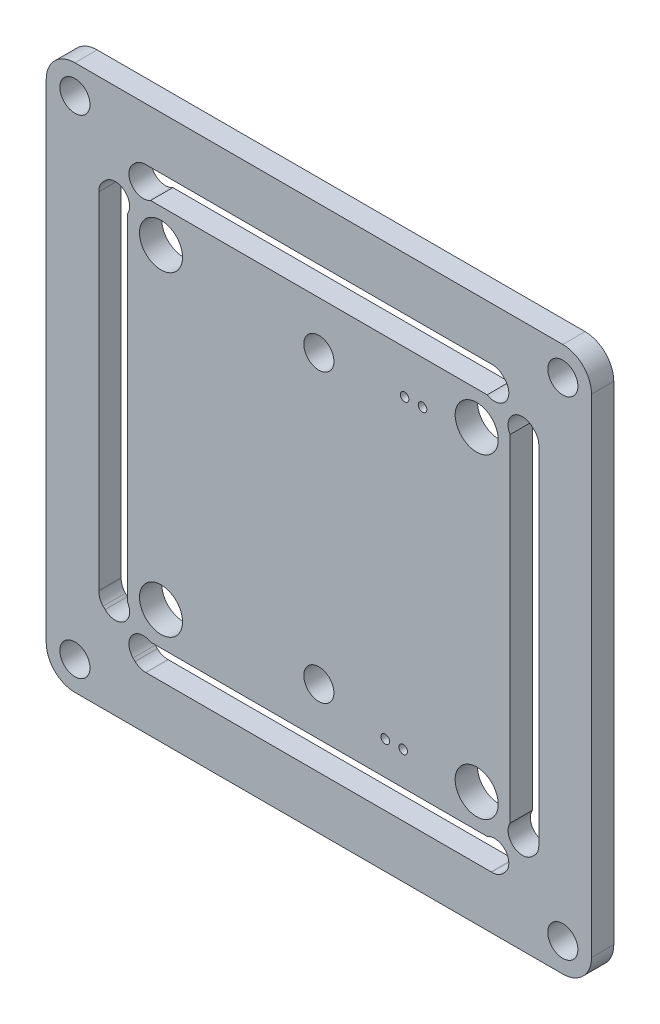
ISO-10303-21;
HEADER;
FILE_DESCRIPTION(('STEP AP214'),'2;1');
FILE_NAME('part.step','',(''),(''),'','','');
FILE_SCHEMA(('AUTOMOTIVE_DESIGN { 1 0 10303 214 1 1 1 1 }'));
ENDSEC;
DATA;
#1=APPLICATION_CONTEXT('core data for automotive mechanical design processes');
#2=APPLICATION_PROTOCOL_DEFINITION('international standard','automotive_design',2000,#1);
#3=PRODUCT_CONTEXT('',#1,'mechanical');
#4=PRODUCT('Part','Part','',(#3));
#5=PRODUCT_RELATED_PRODUCT_CATEGORY('part','',(#4));
#6=PRODUCT_DEFINITION_FORMATION('','',#4);
#7=PRODUCT_DEFINITION_CONTEXT('part definition',#1,'design');
#8=PRODUCT_DEFINITION('design','',#6,#7);
#9=PRODUCT_DEFINITION_SHAPE('','',#8);
#10=(LENGTH_UNIT() NAMED_UNIT(*) SI_UNIT(.MILLI.,.METRE.));
#11=(NAMED_UNIT(*) PLANE_ANGLE_UNIT() SI_UNIT($,.RADIAN.));
#12=(NAMED_UNIT(*) SI_UNIT($,.STERADIAN.) SOLID_ANGLE_UNIT());
#13=UNCERTAINTY_MEASURE_WITH_UNIT(LENGTH_MEASURE(1.E-05),#10,'distance_accuracy_value','');
#14=(GEOMETRIC_REPRESENTATION_CONTEXT(3) GLOBAL_UNCERTAINTY_ASSIGNED_CONTEXT((#13)) GLOBAL_UNIT_ASSIGNED_CONTEXT((#10,
#11,#12)) REPRESENTATION_CONTEXT('',''));
#15=CARTESIAN_POINT('',(0.,0.,0.));
#16=DIRECTION('',(0.,0.,1.));
#17=DIRECTION('',(1.,0.,0.));
#18=AXIS2_PLACEMENT_3D('',#15,#16,#17);
#19=CARTESIAN_POINT('',(0.,0.,1.55400502));
#20=DIRECTION('',(0.,0.,-1.));
#21=DIRECTION('',(0.,-1.,0.));
#22=AXIS2_PLACEMENT_3D('',#19,#20,#21);
#23=PLANE('',#22);
#24=CARTESIAN_POINT('',(17.,17.,1.55400502));
#25=DIRECTION('',(0.,0.,1.));
#26=DIRECTION('',(1.,0.,0.));
#27=AXIS2_PLACEMENT_3D('',#24,#25,#26);
#28=CIRCLE('',#27,1.05);
#29=CARTESIAN_POINT('',(18.05,17.,1.55400502));
#30=VERTEX_POINT('',#29);
#31=EDGE_CURVE('E25',#30,#30,#28,.T.);
#32=ORIENTED_EDGE('',*,*,#31,.F.);
#33=EDGE_LOOP('',(#32));
#34=FACE_BOUND('',#33,.T.);
#35=CARTESIAN_POINT('',(11.,11.,1.55400502));
#36=DIRECTION('',(0.,0.,1.));
#37=DIRECTION('',(1.,0.,0.));
#38=AXIS2_PLACEMENT_3D('',#35,#36,#37);
#39=CIRCLE('',#38,1.5);
#40=CARTESIAN_POINT('',(12.5,11.,1.55400502));
#41=VERTEX_POINT('',#40);
#42=EDGE_CURVE('E746',#41,#41,#39,.T.);
#43=ORIENTED_EDGE('',*,*,#42,.F.);
#44=EDGE_LOOP('',(#43));
#45=FACE_BOUND('',#44,.T.);
#46=CARTESIAN_POINT('',(7.225,10.325,1.55400502));
#47=DIRECTION('',(0.,0.,1.));
#48=DIRECTION('',(1.,0.,0.));
#49=AXIS2_PLACEMENT_3D('',#46,#47,#48);
#50=CIRCLE('',#49,0.3);
#51=CARTESIAN_POINT('',(7.525,10.325,1.55400502));
#52=VERTEX_POINT('',#51);
#53=EDGE_CURVE('E829',#52,#52,#50,.T.);
#54=ORIENTED_EDGE('',*,*,#53,.F.);
#55=EDGE_LOOP('',(#54));
#56=FACE_BOUND('',#55,.T.);
#57=CARTESIAN_POINT('',(5.975,10.325,1.55400502));
#58=DIRECTION('',(0.,0.,1.));
#59=DIRECTION('',(1.,0.,0.));
#60=AXIS2_PLACEMENT_3D('',#57,#58,#59);
#61=CIRCLE('',#60,0.3);
#62=CARTESIAN_POINT('',(6.275,10.325,1.55400502));
#63=VERTEX_POINT('',#62);
#64=EDGE_CURVE('E819',#63,#63,#61,.T.);
#65=ORIENTED_EDGE('',*,*,#64,.F.);
#66=EDGE_LOOP('',(#65));
#67=FACE_BOUND('',#66,.T.);
#68=CARTESIAN_POINT('',(4.625,-11.,1.55400502));
#69=DIRECTION('',(0.,0.,1.));
#70=DIRECTION('',(1.,0.,0.));
#71=AXIS2_PLACEMENT_3D('',#68,#69,#70);
#72=CIRCLE('',#71,0.3);
#73=CARTESIAN_POINT('',(4.925,-11.,1.55400502));
#74=VERTEX_POINT('',#73);
#75=EDGE_CURVE('E809',#74,#74,#72,.T.);
#76=ORIENTED_EDGE('',*,*,#75,.F.);
#77=EDGE_LOOP('',(#76));
#78=FACE_BOUND('',#77,.T.);
#79=DIRECTION('',(0.,-1.,0.));
#80=VECTOR('',#79,1.);
#81=CARTESIAN_POINT('',(13.326,11.729,1.55400502));
#82=LINE('',#81,#80);
#83=CARTESIAN_POINT('',(13.326,11.729,1.55400502));
#84=VERTEX_POINT('',#83);
#85=CARTESIAN_POINT('',(13.326,-11.729,1.55400502));
#86=VERTEX_POINT('',#85);
#87=EDGE_CURVE('E799',#84,#86,#82,.T.);
#88=ORIENTED_EDGE('',*,*,#87,.F.);
#89=CARTESIAN_POINT('',(14.187452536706,12.237708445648,1.55400502));
#90=DIRECTION('',(0.,0.,1.));
#91=DIRECTION('',(0.707234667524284,0.706978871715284,0.));
#92=AXIS2_PLACEMENT_3D('',#89,#90,#91);
#93=CIRCLE('',#92,1.00044228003);
#94=CARTESIAN_POINT('',(14.895,12.945,1.55400502));
#95=VERTEX_POINT('',#94);
#96=EDGE_CURVE('E787',#95,#84,#93,.T.);
#97=ORIENTED_EDGE('',*,*,#96,.F.);
#98=DIRECTION('',(-0.707106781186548,0.707106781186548,0.));
#99=VECTOR('',#98,1.);
#100=CARTESIAN_POINT('',(15.034,12.806,1.55400502));
#101=LINE('',#100,#99);
#102=CARTESIAN_POINT('',(15.034,12.806,1.55400502));
#103=VERTEX_POINT('',#102);
#104=EDGE_CURVE('E775',#103,#95,#101,.T.);
#105=ORIENTED_EDGE('',*,*,#104,.F.);
#106=CARTESIAN_POINT('',(14.326169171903,12.098442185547,1.55400502));
#107=DIRECTION('',(0.,0.,1.));
#108=DIRECTION('',(0.999999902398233,-0.000441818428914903,0.));
#109=AXIS2_PLACEMENT_3D('',#106,#107,#108);
#110=CIRCLE('',#109,1.00083092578);
#111=CARTESIAN_POINT('',(15.327,12.098,1.55400502));
#112=VERTEX_POINT('',#111);
#113=EDGE_CURVE('E766',#112,#103,#110,.T.);
#114=ORIENTED_EDGE('',*,*,#113,.F.);
#115=DIRECTION('',(0.,1.,0.));
#116=VECTOR('',#115,1.);
#117=CARTESIAN_POINT('',(15.327,-12.098,1.55400502));
#118=LINE('',#117,#116);
#119=CARTESIAN_POINT('',(15.327,-12.098,1.55400502));
#120=VERTEX_POINT('',#119);
#121=EDGE_CURVE('E754',#120,#112,#118,.T.);
#122=ORIENTED_EDGE('',*,*,#121,.F.);
#123=CARTESIAN_POINT('',(14.326169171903,-12.09844218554,1.55400502));
#124=DIRECTION('',(0.,0.,1.));
#125=DIRECTION('',(0.70724316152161,-0.70697037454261,0.));
#126=AXIS2_PLACEMENT_3D('',#123,#124,#125);
#127=CIRCLE('',#126,1.00083092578);
#128=CARTESIAN_POINT('',(15.034,-12.806,1.55400502));
#129=VERTEX_POINT('',#128);
#130=EDGE_CURVE('E619',#129,#120,#127,.T.);
#131=ORIENTED_EDGE('',*,*,#130,.F.);
#132=DIRECTION('',(0.707106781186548,0.707106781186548,0.));
#133=VECTOR('',#132,1.);
#134=CARTESIAN_POINT('',(14.895,-12.945,1.55400502));
#135=LINE('',#134,#133);
#136=CARTESIAN_POINT('',(14.895,-12.945,1.55400502));
#137=VERTEX_POINT('',#136);
#138=EDGE_CURVE('E731',#137,#129,#135,.T.);
#139=ORIENTED_EDGE('',*,*,#138,.F.);
#140=CARTESIAN_POINT('',(14.187452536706,-12.23770844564,1.55400502));
#141=DIRECTION('',(0.,0.,1.));
#142=DIRECTION('',(-0.861071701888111,0.508483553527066,0.));
#143=AXIS2_PLACEMENT_3D('',#140,#141,#142);
#144=CIRCLE('',#143,1.00044228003);
#145=EDGE_CURVE('E719',#86,#137,#144,.T.);
#146=ORIENTED_EDGE('',*,*,#145,.F.);
#147=EDGE_LOOP('',(#88,#97,#105,#114,#122,#131,#139,#146));
#148=FACE_BOUND('',#147,.T.);
#149=CARTESIAN_POINT('',(17.,-17.,1.55400502));
#150=DIRECTION('',(0.,0.,1.));
#151=DIRECTION('',(1.,0.,0.));
#152=AXIS2_PLACEMENT_3D('',#149,#150,#151);
#153=CIRCLE('',#152,1.05);
#154=CARTESIAN_POINT('',(18.05,-17.,1.55400502));
#155=VERTEX_POINT('',#154);
#156=EDGE_CURVE('E709',#155,#155,#153,.T.);
#157=ORIENTED_EDGE('',*,*,#156,.F.);
#158=EDGE_LOOP('',(#157));
#159=FACE_BOUND('',#158,.T.);
#160=CARTESIAN_POINT('',(11.,-11.,1.55400502));
#161=DIRECTION('',(0.,0.,1.));
#162=DIRECTION('',(1.,0.,0.));
#163=AXIS2_PLACEMENT_3D('',#160,#161,#162);
#164=CIRCLE('',#163,1.5);
#165=CARTESIAN_POINT('',(12.5,-11.,1.55400502));
#166=VERTEX_POINT('',#165);
#167=EDGE_CURVE('E699',#166,#166,#164,.T.);
#168=ORIENTED_EDGE('',*,*,#167,.F.);
#169=EDGE_LOOP('',(#168));
#170=FACE_BOUND('',#169,.T.);
#171=CARTESIAN_POINT('',(5.875,-11.,1.55400502));
#172=DIRECTION('',(0.,0.,1.));
#173=DIRECTION('',(1.,0.,0.));
#174=AXIS2_PLACEMENT_3D('',#171,#172,#173);
#175=CIRCLE('',#174,0.3);
#176=CARTESIAN_POINT('',(6.175,-11.,1.55400502));
#177=VERTEX_POINT('',#176);
#178=EDGE_CURVE('E692',#177,#177,#175,.T.);
#179=ORIENTED_EDGE('',*,*,#178,.F.);
#180=EDGE_LOOP('',(#179));
#181=FACE_BOUND('',#180,.T.);
#182=CARTESIAN_POINT('',(0.,10.,1.55400502));
#183=DIRECTION('',(0.,0.,1.));
#184=DIRECTION('',(1.,0.,0.));
#185=AXIS2_PLACEMENT_3D('',#182,#183,#184);
#186=CIRCLE('',#185,1.05);
#187=CARTESIAN_POINT('',(1.05,10.,1.55400502));
#188=VERTEX_POINT('',#187);
#189=EDGE_CURVE('E684',#188,#188,#186,.T.);
#190=ORIENTED_EDGE('',*,*,#189,.F.);
#191=EDGE_LOOP('',(#190));
#192=FACE_BOUND('',#191,.T.);
#193=DIRECTION('',(0.707106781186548,0.707106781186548,0.));
#194=VECTOR('',#193,1.);
#195=CARTESIAN_POINT('',(-12.945,14.895,1.55400502));
#196=LINE('',#195,#194);
#197=CARTESIAN_POINT('',(-12.945,14.895,1.55400502));
#198=VERTEX_POINT('',#197);
#199=CARTESIAN_POINT('',(-12.806,15.034,1.55400502));
#200=VERTEX_POINT('',#199);
#201=EDGE_CURVE('E676',#198,#200,#196,.T.);
#202=ORIENTED_EDGE('',*,*,#201,.T.);
#203=CARTESIAN_POINT('',(-12.09700439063,14.32320145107,1.55400502));
#204=DIRECTION('',(0.,0.,-1.));
#205=DIRECTION('',(-0.706208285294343,0.708004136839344,0.));
#206=AXIS2_PLACEMENT_3D('',#203,#204,#205);
#207=CIRCLE('',#206,1.003946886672);
#208=CARTESIAN_POINT('',(-12.049,15.326,1.55400502));
#209=VERTEX_POINT('',#208);
#210=EDGE_CURVE('E675',#200,#209,#207,.T.);
#211=ORIENTED_EDGE('',*,*,#210,.T.);
#212=DIRECTION('',(0.999791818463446,0.0204039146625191,0.));
#213=VECTOR('',#212,1.);
#214=CARTESIAN_POINT('',(-12.049,15.326,1.55400502));
#215=LINE('',#214,#213);
#216=CARTESIAN_POINT('',(-12.,15.327,1.55400502));
#217=VERTEX_POINT('',#216);
#218=EDGE_CURVE('E595',#209,#217,#215,.T.);
#219=ORIENTED_EDGE('',*,*,#218,.T.);
#220=DIRECTION('',(1.,0.,0.));
#221=VECTOR('',#220,1.);
#222=CARTESIAN_POINT('',(-12.,15.327,1.55400502));
#223=LINE('',#222,#221);
#224=CARTESIAN_POINT('',(12.047,15.327,1.55400502));
#225=VERTEX_POINT('',#224);
#226=EDGE_CURVE('E639',#217,#225,#223,.T.);
#227=ORIENTED_EDGE('',*,*,#226,.T.);
#228=DIRECTION('',(1.,0.,0.));
#229=VECTOR('',#228,1.);
#230=CARTESIAN_POINT('',(12.047,15.327,1.55400502));
#231=LINE('',#230,#229);
#232=CARTESIAN_POINT('',(12.073,15.327,1.55400502));
#233=VERTEX_POINT('',#232);
#234=EDGE_CURVE('E609',#225,#233,#231,.T.);
#235=ORIENTED_EDGE('',*,*,#234,.T.);
#236=CARTESIAN_POINT('',(12.097859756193,14.325816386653,1.55400502));
#237=DIRECTION('',(0.,0.,-1.));
#238=DIRECTION('',(-0.0248227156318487,0.99969186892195,0.));
#239=AXIS2_PLACEMENT_3D('',#236,#237,#238);
#240=CIRCLE('',#239,1.001492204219);
#241=CARTESIAN_POINT('',(12.806,15.034,1.55400502));
#242=VERTEX_POINT('',#241);
#243=EDGE_CURVE('E523',#233,#242,#240,.T.);
#244=ORIENTED_EDGE('',*,*,#243,.T.);
#245=DIRECTION('',(0.707106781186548,-0.707106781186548,0.));
#246=VECTOR('',#245,1.);
#247=CARTESIAN_POINT('',(12.806,15.034,1.55400502));
#248=LINE('',#247,#246);
#249=CARTESIAN_POINT('',(12.945,14.895,1.55400502));
#250=VERTEX_POINT('',#249);
#251=EDGE_CURVE('E516',#242,#250,#248,.T.);
#252=ORIENTED_EDGE('',*,*,#251,.T.);
#253=CARTESIAN_POINT('',(12.237708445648,14.187452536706,1.55400502));
#254=DIRECTION('',(0.,0.,-1.));
#255=DIRECTION('',(0.706978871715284,0.707234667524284,0.));
#256=AXIS2_PLACEMENT_3D('',#253,#254,#255);
#257=CIRCLE('',#256,1.00044228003);
#258=CARTESIAN_POINT('',(11.729,13.326,1.55400502));
#259=VERTEX_POINT('',#258);
#260=EDGE_CURVE('E520',#250,#259,#257,.T.);
#261=ORIENTED_EDGE('',*,*,#260,.T.);
#262=DIRECTION('',(-1.,0.,0.));
#263=VECTOR('',#262,1.);
#264=CARTESIAN_POINT('',(11.729,13.326,1.55400502));
#265=LINE('',#264,#263);
#266=CARTESIAN_POINT('',(-11.729,13.326,1.55400502));
#267=VERTEX_POINT('',#266);
#268=EDGE_CURVE('E656',#259,#267,#265,.T.);
#269=ORIENTED_EDGE('',*,*,#268,.T.);
#270=CARTESIAN_POINT('',(-12.23770844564,14.187452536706,1.55400502));
#271=DIRECTION('',(0.,0.,-1.));
#272=DIRECTION('',(0.508483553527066,-0.861071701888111,0.));
#273=AXIS2_PLACEMENT_3D('',#270,#271,#272);
#274=CIRCLE('',#273,1.00044228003);
#275=EDGE_CURVE('E647',#267,#198,#274,.T.);
#276=ORIENTED_EDGE('',*,*,#275,.T.);
#277=EDGE_LOOP('',(#202,#211,#219,#227,#235,#244,#252,#261,#269,#276));
#278=FACE_BOUND('',#277,.T.);
#279=CARTESIAN_POINT('',(0.,-10.,1.55400502));
#280=DIRECTION('',(0.,0.,1.));
#281=DIRECTION('',(1.,0.,0.));
#282=AXIS2_PLACEMENT_3D('',#279,#280,#281);
#283=CIRCLE('',#282,1.05);
#284=CARTESIAN_POINT('',(1.05,-10.,1.55400502));
#285=VERTEX_POINT('',#284);
#286=EDGE_CURVE('E638',#285,#285,#283,.T.);
#287=ORIENTED_EDGE('',*,*,#286,.F.);
#288=EDGE_LOOP('',(#287));
#289=FACE_BOUND('',#288,.T.);
#290=CARTESIAN_POINT('',(-17.,17.,1.55400502));
#291=DIRECTION('',(0.,0.,1.));
#292=DIRECTION('',(1.,0.,0.));
#293=AXIS2_PLACEMENT_3D('',#290,#291,#292);
#294=CIRCLE('',#293,1.05);
#295=CARTESIAN_POINT('',(-15.95,17.,1.55400502));
#296=VERTEX_POINT('',#295);
#297=EDGE_CURVE('E629',#296,#296,#294,.T.);
#298=ORIENTED_EDGE('',*,*,#297,.F.);
#299=EDGE_LOOP('',(#298));
#300=FACE_BOUND('',#299,.T.);
#301=CARTESIAN_POINT('',(-11.,11.,1.55400502));
#302=DIRECTION('',(0.,0.,1.));
#303=DIRECTION('',(1.,0.,0.));
#304=AXIS2_PLACEMENT_3D('',#301,#302,#303);
#305=CIRCLE('',#304,1.5);
#306=CARTESIAN_POINT('',(-9.5,11.,1.55400502));
#307=VERTEX_POINT('',#306);
#308=EDGE_CURVE('E1387',#307,#307,#305,.T.);
#309=ORIENTED_EDGE('',*,*,#308,.F.);
#310=EDGE_LOOP('',(#309));
#311=FACE_BOUND('',#310,.T.);
#312=CARTESIAN_POINT('',(-11.,-11.,1.55400502));
#313=DIRECTION('',(0.,0.,1.));
#314=DIRECTION('',(1.,0.,0.));
#315=AXIS2_PLACEMENT_3D('',#312,#313,#314);
#316=CIRCLE('',#315,1.5);
#317=CARTESIAN_POINT('',(-9.5,-11.,1.55400502));
#318=VERTEX_POINT('',#317);
#319=EDGE_CURVE('E580',#318,#318,#316,.T.);
#320=ORIENTED_EDGE('',*,*,#319,.F.);
#321=EDGE_LOOP('',(#320));
#322=FACE_BOUND('',#321,.T.);
#323=DIRECTION('',(0.707106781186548,-0.707106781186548,0.));
#324=VECTOR('',#323,1.);
#325=CARTESIAN_POINT('',(-12.945,-14.895,1.55400502));
#326=LINE('',#325,#324);
#327=CARTESIAN_POINT('',(-12.945,-14.895,1.55400502));
#328=VERTEX_POINT('',#327);
#329=CARTESIAN_POINT('',(-12.806,-15.034,1.55400502));
#330=VERTEX_POINT('',#329);
#331=EDGE_CURVE('E600',#328,#330,#326,.T.);
#332=ORIENTED_EDGE('',*,*,#331,.F.);
#333=CARTESIAN_POINT('',(-12.23770844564,-14.1874525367,1.55400502));
#334=DIRECTION('',(0.,0.,1.));
#335=DIRECTION('',(0.508483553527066,0.861071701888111,0.));
#336=AXIS2_PLACEMENT_3D('',#333,#334,#335);
#337=CIRCLE('',#336,1.00044228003);
#338=CARTESIAN_POINT('',(-11.729,-13.326,1.55400502));
#339=VERTEX_POINT('',#338);
#340=EDGE_CURVE('E574',#339,#328,#337,.T.);
#341=ORIENTED_EDGE('',*,*,#340,.F.);
#342=DIRECTION('',(-1.,0.,0.));
#343=VECTOR('',#342,1.);
#344=CARTESIAN_POINT('',(11.729,-13.326,1.55400502));
#345=LINE('',#344,#343);
#346=CARTESIAN_POINT('',(11.729,-13.326,1.55400502));
#347=VERTEX_POINT('',#346);
#348=EDGE_CURVE('E569',#347,#339,#345,.T.);
#349=ORIENTED_EDGE('',*,*,#348,.F.);
#350=CARTESIAN_POINT('',(12.237708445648,-14.1874525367,1.55400502));
#351=DIRECTION('',(0.,0.,1.));
#352=DIRECTION('',(0.706978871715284,-0.707234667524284,0.));
#353=AXIS2_PLACEMENT_3D('',#350,#351,#352);
#354=CIRCLE('',#353,1.00044228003);
#355=CARTESIAN_POINT('',(12.945,-14.895,1.55400502));
#356=VERTEX_POINT('',#355);
#357=EDGE_CURVE('E555',#356,#347,#354,.T.);
#358=ORIENTED_EDGE('',*,*,#357,.F.);
#359=DIRECTION('',(0.707106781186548,0.707106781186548,0.));
#360=VECTOR('',#359,1.);
#361=CARTESIAN_POINT('',(12.806,-15.034,1.55400502));
#362=LINE('',#361,#360);
#363=CARTESIAN_POINT('',(12.806,-15.034,1.55400502));
#364=VERTEX_POINT('',#363);
#365=EDGE_CURVE('E1113',#364,#356,#362,.T.);
#366=ORIENTED_EDGE('',*,*,#365,.F.);
#367=CARTESIAN_POINT('',(12.097004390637,-14.32320145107,1.55400502));
#368=DIRECTION('',(0.,0.,1.));
#369=DIRECTION('',(-0.0478156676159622,-0.998856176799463,0.));
#370=AXIS2_PLACEMENT_3D('',#367,#368,#369);
#371=CIRCLE('',#370,1.003946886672);
#372=CARTESIAN_POINT('',(12.049,-15.326,1.55400502));
#373=VERTEX_POINT('',#372);
#374=EDGE_CURVE('E1472',#373,#364,#371,.T.);
#375=ORIENTED_EDGE('',*,*,#374,.F.);
#376=DIRECTION('',(0.999791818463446,0.0204039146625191,0.));
#377=VECTOR('',#376,1.);
#378=CARTESIAN_POINT('',(12.,-15.327,1.55400502));
#379=LINE('',#378,#377);
#380=CARTESIAN_POINT('',(12.,-15.327,1.55400502));
#381=VERTEX_POINT('',#380);
#382=EDGE_CURVE('E1490',#381,#373,#379,.T.);
#383=ORIENTED_EDGE('',*,*,#382,.F.);
#384=DIRECTION('',(1.,0.,0.));
#385=VECTOR('',#384,1.);
#386=CARTESIAN_POINT('',(-12.047,-15.327,1.55400502));
#387=LINE('',#386,#385);
#388=CARTESIAN_POINT('',(-12.047,-15.327,1.55400502));
#389=VERTEX_POINT('',#388);
#390=EDGE_CURVE('E1122',#389,#381,#387,.T.);
#391=ORIENTED_EDGE('',*,*,#390,.F.);
#392=DIRECTION('',(1.,0.,0.));
#393=VECTOR('',#392,1.);
#394=CARTESIAN_POINT('',(-12.073,-15.327,1.55400502));
#395=LINE('',#394,#393);
#396=CARTESIAN_POINT('',(-12.073,-15.327,1.55400502));
#397=VERTEX_POINT('',#396);
#398=EDGE_CURVE('E1518',#397,#389,#395,.T.);
#399=ORIENTED_EDGE('',*,*,#398,.F.);
#400=CARTESIAN_POINT('',(-12.09785975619,-14.32581638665,1.55400502));
#401=DIRECTION('',(0.,0.,1.));
#402=DIRECTION('',(-0.707085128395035,-0.707128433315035,0.));
#403=AXIS2_PLACEMENT_3D('',#400,#401,#402);
#404=CIRCLE('',#403,1.001492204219);
#405=EDGE_CURVE('E1534',#330,#397,#404,.T.);
#406=ORIENTED_EDGE('',*,*,#405,.F.);
#407=EDGE_LOOP('',(#332,#341,#349,#358,#366,#375,#383,#391,#399,#406));
#408=FACE_BOUND('',#407,.T.);
#409=CARTESIAN_POINT('',(-14.32320145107,-12.09700439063,1.55400502));
#410=DIRECTION('',(0.,0.,-1.));
#411=DIRECTION('',(-0.708004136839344,-0.706208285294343,0.));
#412=AXIS2_PLACEMENT_3D('',#409,#410,#411);
#413=CIRCLE('',#412,1.003946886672);
#414=CARTESIAN_POINT('',(-15.034,-12.806,1.55400502));
#415=VERTEX_POINT('',#414);
#416=CARTESIAN_POINT('',(-15.326,-12.049,1.55400502));
#417=VERTEX_POINT('',#416);
#418=EDGE_CURVE('E1547',#415,#417,#413,.T.);
#419=ORIENTED_EDGE('',*,*,#418,.T.);
#420=DIRECTION('',(-0.0204039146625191,0.999791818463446,0.));
#421=VECTOR('',#420,1.);
#422=CARTESIAN_POINT('',(-15.326,-12.049,1.55400502));
#423=LINE('',#422,#421);
#424=CARTESIAN_POINT('',(-15.327,-12.,1.55400502));
#425=VERTEX_POINT('',#424);
#426=EDGE_CURVE('E1556',#417,#425,#423,.T.);
#427=ORIENTED_EDGE('',*,*,#426,.T.);
#428=DIRECTION('',(0.,1.,0.));
#429=VECTOR('',#428,1.);
#430=CARTESIAN_POINT('',(-15.327,-12.,1.55400502));
#431=LINE('',#430,#429);
#432=CARTESIAN_POINT('',(-15.327,12.047,1.55400502));
#433=VERTEX_POINT('',#432);
#434=EDGE_CURVE('E1142',#425,#433,#431,.T.);
#435=ORIENTED_EDGE('',*,*,#434,.T.);
#436=DIRECTION('',(0.,1.,0.));
#437=VECTOR('',#436,1.);
#438=CARTESIAN_POINT('',(-15.327,12.047,1.55400502));
#439=LINE('',#438,#437);
#440=CARTESIAN_POINT('',(-15.327,12.073,1.55400502));
#441=VERTEX_POINT('',#440);
#442=EDGE_CURVE('E1667',#433,#441,#439,.T.);
#443=ORIENTED_EDGE('',*,*,#442,.T.);
#444=CARTESIAN_POINT('',(-14.32581638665,12.097859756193,1.55400502));
#445=DIRECTION('',(0.,0.,-1.));
#446=DIRECTION('',(-0.99969186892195,-0.0248227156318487,0.));
#447=AXIS2_PLACEMENT_3D('',#444,#445,#446);
#448=CIRCLE('',#447,1.001492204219);
#449=CARTESIAN_POINT('',(-15.034,12.806,1.55400502));
#450=VERTEX_POINT('',#449);
#451=EDGE_CURVE('E1569',#441,#450,#448,.T.);
#452=ORIENTED_EDGE('',*,*,#451,.T.);
#453=DIRECTION('',(0.707106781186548,0.707106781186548,0.));
#454=VECTOR('',#453,1.);
#455=CARTESIAN_POINT('',(-15.034,12.806,1.55400502));
#456=LINE('',#455,#454);
#457=CARTESIAN_POINT('',(-14.895,12.945,1.55400502));
#458=VERTEX_POINT('',#457);
#459=EDGE_CURVE('E1590',#450,#458,#456,.T.);
#460=ORIENTED_EDGE('',*,*,#459,.T.);
#461=CARTESIAN_POINT('',(-14.1874525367,12.237708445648,1.55400502));
#462=DIRECTION('',(0.,0.,-1.));
#463=DIRECTION('',(-0.707234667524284,0.706978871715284,0.));
#464=AXIS2_PLACEMENT_3D('',#461,#462,#463);
#465=CIRCLE('',#464,1.00044228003);
#466=CARTESIAN_POINT('',(-13.326,11.729,1.55400502));
#467=VERTEX_POINT('',#466);
#468=EDGE_CURVE('E1607',#458,#467,#465,.T.);
#469=ORIENTED_EDGE('',*,*,#468,.T.);
#470=DIRECTION('',(0.,-1.,0.));
#471=VECTOR('',#470,1.);
#472=CARTESIAN_POINT('',(-13.326,11.729,1.55400502));
#473=LINE('',#472,#471);
#474=CARTESIAN_POINT('',(-13.326,-11.729,1.55400502));
#475=VERTEX_POINT('',#474);
#476=EDGE_CURVE('E1623',#467,#475,#473,.T.);
#477=ORIENTED_EDGE('',*,*,#476,.T.);
#478=CARTESIAN_POINT('',(-14.1874525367,-12.23770844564,1.55400502));
#479=DIRECTION('',(0.,0.,-1.));
#480=DIRECTION('',(0.861071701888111,0.508483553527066,0.));
#481=AXIS2_PLACEMENT_3D('',#478,#479,#480);
#482=CIRCLE('',#481,1.00044228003);
#483=CARTESIAN_POINT('',(-14.895,-12.945,1.55400502));
#484=VERTEX_POINT('',#483);
#485=EDGE_CURVE('E1640',#475,#484,#482,.T.);
#486=ORIENTED_EDGE('',*,*,#485,.T.);
#487=DIRECTION('',(-0.707106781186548,0.707106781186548,0.));
#488=VECTOR('',#487,1.);
#489=CARTESIAN_POINT('',(-14.895,-12.945,1.55400502));
#490=LINE('',#489,#488);
#491=EDGE_CURVE('E1134',#484,#415,#490,.T.);
#492=ORIENTED_EDGE('',*,*,#491,.T.);
#493=EDGE_LOOP('',(#419,#427,#435,#443,#452,#460,#469,#477,#486,#492));
#494=FACE_BOUND('',#493,.T.);
#495=CARTESIAN_POINT('',(-17.,-17.,1.55400502));
#496=DIRECTION('',(0.,0.,1.));
#497=DIRECTION('',(1.,0.,0.));
#498=AXIS2_PLACEMENT_3D('',#495,#496,#497);
#499=CIRCLE('',#498,1.05);
#500=CARTESIAN_POINT('',(-15.95,-17.,1.55400502));
#501=VERTEX_POINT('',#500);
#502=EDGE_CURVE('E1173',#501,#501,#499,.T.);
#503=ORIENTED_EDGE('',*,*,#502,.F.);
#504=EDGE_LOOP('',(#503));
#505=FACE_BOUND('',#504,.T.);
#506=CARTESIAN_POINT('',(-16.9992705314,-16.9992705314,1.55400502));
#507=DIRECTION('',(0.,0.,-1.));
#508=DIRECTION('',(-0.000364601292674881,-0.999999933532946,0.));
#509=AXIS2_PLACEMENT_3D('',#506,#507,#508);
#510=CIRCLE('',#509,2.000729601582);
#511=CARTESIAN_POINT('',(-17.,-19.,1.55400502));
#512=VERTEX_POINT('',#511);
#513=CARTESIAN_POINT('',(-19.,-17.,1.55400502));
#514=VERTEX_POINT('',#513);
#515=EDGE_CURVE('E1195',#512,#514,#510,.T.);
#516=ORIENTED_EDGE('',*,*,#515,.F.);
#517=DIRECTION('',(-1.,0.,0.));
#518=VECTOR('',#517,1.);
#519=CARTESIAN_POINT('',(17.,-19.,1.55400502));
#520=LINE('',#519,#518);
#521=CARTESIAN_POINT('',(17.,-19.,1.55400502));
#522=VERTEX_POINT('',#521);
#523=EDGE_CURVE('E1219',#522,#512,#520,.T.);
#524=ORIENTED_EDGE('',*,*,#523,.F.);
#525=CARTESIAN_POINT('',(16.999270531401,-16.9992705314,1.55400502));
#526=DIRECTION('',(0.,0.,-1.));
#527=DIRECTION('',(0.999999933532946,-0.000364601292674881,0.));
#528=AXIS2_PLACEMENT_3D('',#525,#526,#527);
#529=CIRCLE('',#528,2.000729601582);
#530=CARTESIAN_POINT('',(19.,-17.,1.55400502));
#531=VERTEX_POINT('',#530);
#532=EDGE_CURVE('E1241',#531,#522,#529,.T.);
#533=ORIENTED_EDGE('',*,*,#532,.F.);
#534=DIRECTION('',(0.,-1.,0.));
#535=VECTOR('',#534,1.);
#536=CARTESIAN_POINT('',(19.,17.,1.55400502));
#537=LINE('',#536,#535);
#538=CARTESIAN_POINT('',(19.,17.,1.55400502));
#539=VERTEX_POINT('',#538);
#540=EDGE_CURVE('E1263',#539,#531,#537,.T.);
#541=ORIENTED_EDGE('',*,*,#540,.F.);
#542=CARTESIAN_POINT('',(16.999270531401,16.999270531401,1.55400502));
#543=DIRECTION('',(0.,0.,-1.));
#544=DIRECTION('',(0.000364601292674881,0.999999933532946,0.));
#545=AXIS2_PLACEMENT_3D('',#542,#543,#544);
#546=CIRCLE('',#545,2.000729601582);
#547=CARTESIAN_POINT('',(17.,19.,1.55400502));
#548=VERTEX_POINT('',#547);
#549=EDGE_CURVE('E1286',#548,#539,#546,.T.);
#550=ORIENTED_EDGE('',*,*,#549,.F.);
#551=DIRECTION('',(1.,0.,0.));
#552=VECTOR('',#551,1.);
#553=CARTESIAN_POINT('',(-17.,19.,1.55400502));
#554=LINE('',#553,#552);
#555=CARTESIAN_POINT('',(-17.,19.,1.55400502));
#556=VERTEX_POINT('',#555);
#557=EDGE_CURVE('E1307',#556,#548,#554,.T.);
#558=ORIENTED_EDGE('',*,*,#557,.F.);
#559=CARTESIAN_POINT('',(-16.9992705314,16.999270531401,1.55400502));
#560=DIRECTION('',(0.,0.,-1.));
#561=DIRECTION('',(-0.999999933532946,0.000364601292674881,0.));
#562=AXIS2_PLACEMENT_3D('',#559,#560,#561);
#563=CIRCLE('',#562,2.000729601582);
#564=CARTESIAN_POINT('',(-19.,17.,1.55400502));
#565=VERTEX_POINT('',#564);
#566=EDGE_CURVE('E1325',#565,#556,#563,.T.);
#567=ORIENTED_EDGE('',*,*,#566,.F.);
#568=DIRECTION('',(0.,1.,0.));
#569=VECTOR('',#568,1.);
#570=CARTESIAN_POINT('',(-19.,-17.,1.55400502));
#571=LINE('',#570,#569);
#572=EDGE_CURVE('E1344',#514,#565,#571,.T.);
#573=ORIENTED_EDGE('',*,*,#572,.F.);
#574=EDGE_LOOP('',(#516,#524,#533,#541,#550,#558,#567,#573));
#575=FACE_BOUND('',#574,.T.);
#576=ADVANCED_FACE('F17',(#34,#45,#56,#67,#78,#148,#159,#170,#181,#192,#278,#289,#300,#311,#322,
#408,#494,#505,#575),#23,.F.);
#577=CARTESIAN_POINT('',(0.,0.,0.));
#578=DIRECTION('',(0.,0.,-1.));
#579=DIRECTION('',(0.,-1.,0.));
#580=AXIS2_PLACEMENT_3D('',#577,#578,#579);
#581=PLANE('',#580);
#582=CARTESIAN_POINT('',(17.,17.,0.));
#583=DIRECTION('',(0.,0.,1.));
#584=DIRECTION('',(1.,0.,0.));
#585=AXIS2_PLACEMENT_3D('',#582,#583,#584);
#586=CIRCLE('',#585,1.05);
#587=CARTESIAN_POINT('',(18.05,17.,0.));
#588=VERTEX_POINT('',#587);
#589=EDGE_CURVE('E11',#588,#588,#586,.T.);
#590=ORIENTED_EDGE('',*,*,#589,.T.);
#591=EDGE_LOOP('',(#590));
#592=FACE_BOUND('',#591,.T.);
#593=CARTESIAN_POINT('',(11.,11.,0.));
#594=DIRECTION('',(0.,0.,1.));
#595=DIRECTION('',(1.,0.,0.));
#596=AXIS2_PLACEMENT_3D('',#593,#594,#595);
#597=CIRCLE('',#596,1.5);
#598=CARTESIAN_POINT('',(12.5,11.,0.));
#599=VERTEX_POINT('',#598);
#600=EDGE_CURVE('E742',#599,#599,#597,.T.);
#601=ORIENTED_EDGE('',*,*,#600,.T.);
#602=EDGE_LOOP('',(#601));
#603=FACE_BOUND('',#602,.T.);
#604=CARTESIAN_POINT('',(7.225,10.325,0.));
#605=DIRECTION('',(0.,0.,1.));
#606=DIRECTION('',(1.,0.,0.));
#607=AXIS2_PLACEMENT_3D('',#604,#605,#606);
#608=CIRCLE('',#607,0.3);
#609=CARTESIAN_POINT('',(7.525,10.325,0.));
#610=VERTEX_POINT('',#609);
#611=EDGE_CURVE('E832',#610,#610,#608,.T.);
#612=ORIENTED_EDGE('',*,*,#611,.T.);
#613=EDGE_LOOP('',(#612));
#614=FACE_BOUND('',#613,.T.);
#615=CARTESIAN_POINT('',(5.975,10.325,0.));
#616=DIRECTION('',(0.,0.,1.));
#617=DIRECTION('',(1.,0.,0.));
#618=AXIS2_PLACEMENT_3D('',#615,#616,#617);
#619=CIRCLE('',#618,0.3);
#620=CARTESIAN_POINT('',(6.275,10.325,0.));
#621=VERTEX_POINT('',#620);
#622=EDGE_CURVE('E822',#621,#621,#619,.T.);
#623=ORIENTED_EDGE('',*,*,#622,.T.);
#624=EDGE_LOOP('',(#623));
#625=FACE_BOUND('',#624,.T.);
#626=CARTESIAN_POINT('',(4.625,-11.,0.));
#627=DIRECTION('',(0.,0.,1.));
#628=DIRECTION('',(1.,0.,0.));
#629=AXIS2_PLACEMENT_3D('',#626,#627,#628);
#630=CIRCLE('',#629,0.3);
#631=CARTESIAN_POINT('',(4.925,-11.,0.));
#632=VERTEX_POINT('',#631);
#633=EDGE_CURVE('E812',#632,#632,#630,.T.);
#634=ORIENTED_EDGE('',*,*,#633,.T.);
#635=EDGE_LOOP('',(#634));
#636=FACE_BOUND('',#635,.T.);
#637=CARTESIAN_POINT('',(14.187452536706,-12.23770844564,0.));
#638=DIRECTION('',(0.,0.,1.));
#639=DIRECTION('',(-0.861071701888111,0.508483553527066,0.));
#640=AXIS2_PLACEMENT_3D('',#637,#638,#639);
#641=CIRCLE('',#640,1.00044228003);
#642=CARTESIAN_POINT('',(13.326,-11.729,0.));
#643=VERTEX_POINT('',#642);
#644=CARTESIAN_POINT('',(14.895,-12.945,0.));
#645=VERTEX_POINT('',#644);
#646=EDGE_CURVE('E727',#643,#645,#641,.T.);
#647=ORIENTED_EDGE('',*,*,#646,.T.);
#648=DIRECTION('',(0.707106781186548,0.707106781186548,0.));
#649=VECTOR('',#648,1.);
#650=CARTESIAN_POINT('',(14.895,-12.945,0.));
#651=LINE('',#650,#649);
#652=CARTESIAN_POINT('',(15.034,-12.806,0.));
#653=VERTEX_POINT('',#652);
#654=EDGE_CURVE('E624',#645,#653,#651,.T.);
#655=ORIENTED_EDGE('',*,*,#654,.T.);
#656=CARTESIAN_POINT('',(14.326169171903,-12.09844218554,0.));
#657=DIRECTION('',(0.,0.,1.));
#658=DIRECTION('',(0.70724316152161,-0.70697037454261,0.));
#659=AXIS2_PLACEMENT_3D('',#656,#657,#658);
#660=CIRCLE('',#659,1.00083092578);
#661=CARTESIAN_POINT('',(15.327,-12.098,0.));
#662=VERTEX_POINT('',#661);
#663=EDGE_CURVE('E750',#653,#662,#660,.T.);
#664=ORIENTED_EDGE('',*,*,#663,.T.);
#665=DIRECTION('',(0.,1.,0.));
#666=VECTOR('',#665,1.);
#667=CARTESIAN_POINT('',(15.327,-12.098,0.));
#668=LINE('',#667,#666);
#669=CARTESIAN_POINT('',(15.327,12.098,0.));
#670=VERTEX_POINT('',#669);
#671=EDGE_CURVE('E762',#662,#670,#668,.T.);
#672=ORIENTED_EDGE('',*,*,#671,.T.);
#673=CARTESIAN_POINT('',(14.326169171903,12.098442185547,0.));
#674=DIRECTION('',(0.,0.,1.));
#675=DIRECTION('',(0.999999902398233,-0.000441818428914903,0.));
#676=AXIS2_PLACEMENT_3D('',#673,#674,#675);
#677=CIRCLE('',#676,1.00083092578);
#678=CARTESIAN_POINT('',(15.034,12.806,0.));
#679=VERTEX_POINT('',#678);
#680=EDGE_CURVE('E771',#670,#679,#677,.T.);
#681=ORIENTED_EDGE('',*,*,#680,.T.);
#682=DIRECTION('',(-0.707106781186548,0.707106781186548,0.));
#683=VECTOR('',#682,1.);
#684=CARTESIAN_POINT('',(15.034,12.806,0.));
#685=LINE('',#684,#683);
#686=CARTESIAN_POINT('',(14.895,12.945,0.));
#687=VERTEX_POINT('',#686);
#688=EDGE_CURVE('E783',#679,#687,#685,.T.);
#689=ORIENTED_EDGE('',*,*,#688,.T.);
#690=CARTESIAN_POINT('',(14.187452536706,12.237708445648,0.));
#691=DIRECTION('',(0.,0.,1.));
#692=DIRECTION('',(0.707234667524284,0.706978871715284,0.));
#693=AXIS2_PLACEMENT_3D('',#690,#691,#692);
#694=CIRCLE('',#693,1.00044228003);
#695=CARTESIAN_POINT('',(13.326,11.729,0.));
#696=VERTEX_POINT('',#695);
#697=EDGE_CURVE('E795',#687,#696,#694,.T.);
#698=ORIENTED_EDGE('',*,*,#697,.T.);
#699=DIRECTION('',(0.,-1.,0.));
#700=VECTOR('',#699,1.);
#701=CARTESIAN_POINT('',(13.326,11.729,0.));
#702=LINE('',#701,#700);
#703=EDGE_CURVE('E802',#696,#643,#702,.T.);
#704=ORIENTED_EDGE('',*,*,#703,.T.);
#705=EDGE_LOOP('',(#647,#655,#664,#672,#681,#689,#698,#704));
#706=FACE_BOUND('',#705,.T.);
#707=CARTESIAN_POINT('',(17.,-17.,0.));
#708=DIRECTION('',(0.,0.,1.));
#709=DIRECTION('',(1.,0.,0.));
#710=AXIS2_PLACEMENT_3D('',#707,#708,#709);
#711=CIRCLE('',#710,1.05);
#712=CARTESIAN_POINT('',(18.05,-17.,0.));
#713=VERTEX_POINT('',#712);
#714=EDGE_CURVE('E712',#713,#713,#711,.T.);
#715=ORIENTED_EDGE('',*,*,#714,.T.);
#716=EDGE_LOOP('',(#715));
#717=FACE_BOUND('',#716,.T.);
#718=CARTESIAN_POINT('',(11.,-11.,0.));
#719=DIRECTION('',(0.,0.,1.));
#720=DIRECTION('',(1.,0.,0.));
#721=AXIS2_PLACEMENT_3D('',#718,#719,#720);
#722=CIRCLE('',#721,1.5);
#723=CARTESIAN_POINT('',(12.5,-11.,0.));
#724=VERTEX_POINT('',#723);
#725=EDGE_CURVE('E702',#724,#724,#722,.T.);
#726=ORIENTED_EDGE('',*,*,#725,.T.);
#727=EDGE_LOOP('',(#726));
#728=FACE_BOUND('',#727,.T.);
#729=CARTESIAN_POINT('',(5.875,-11.,0.));
#730=DIRECTION('',(0.,0.,1.));
#731=DIRECTION('',(1.,0.,0.));
#732=AXIS2_PLACEMENT_3D('',#729,#730,#731);
#733=CIRCLE('',#732,0.3);
#734=CARTESIAN_POINT('',(6.175,-11.,0.));
#735=VERTEX_POINT('',#734);
#736=EDGE_CURVE('E695',#735,#735,#733,.T.);
#737=ORIENTED_EDGE('',*,*,#736,.T.);
#738=EDGE_LOOP('',(#737));
#739=FACE_BOUND('',#738,.T.);
#740=CARTESIAN_POINT('',(0.,10.,0.));
#741=DIRECTION('',(0.,0.,1.));
#742=DIRECTION('',(1.,0.,0.));
#743=AXIS2_PLACEMENT_3D('',#740,#741,#742);
#744=CIRCLE('',#743,1.05);
#745=CARTESIAN_POINT('',(1.05,10.,0.));
#746=VERTEX_POINT('',#745);
#747=EDGE_CURVE('E687',#746,#746,#744,.T.);
#748=ORIENTED_EDGE('',*,*,#747,.T.);
#749=EDGE_LOOP('',(#748));
#750=FACE_BOUND('',#749,.T.);
#751=CARTESIAN_POINT('',(-12.23770844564,14.187452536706,0.));
#752=DIRECTION('',(0.,0.,-1.));
#753=DIRECTION('',(0.508483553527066,-0.861071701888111,0.));
#754=AXIS2_PLACEMENT_3D('',#751,#752,#753);
#755=CIRCLE('',#754,1.00044228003);
#756=CARTESIAN_POINT('',(-11.729,13.326,0.));
#757=VERTEX_POINT('',#756);
#758=CARTESIAN_POINT('',(-12.945,14.895,0.));
#759=VERTEX_POINT('',#758);
#760=EDGE_CURVE('E648',#757,#759,#755,.T.);
#761=ORIENTED_EDGE('',*,*,#760,.F.);
#762=DIRECTION('',(-1.,0.,0.));
#763=VECTOR('',#762,1.);
#764=CARTESIAN_POINT('',(11.729,13.326,0.));
#765=LINE('',#764,#763);
#766=CARTESIAN_POINT('',(11.729,13.326,0.));
#767=VERTEX_POINT('',#766);
#768=EDGE_CURVE('E653',#767,#757,#765,.T.);
#769=ORIENTED_EDGE('',*,*,#768,.F.);
#770=CARTESIAN_POINT('',(12.237708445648,14.187452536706,0.));
#771=DIRECTION('',(0.,0.,-1.));
#772=DIRECTION('',(0.706978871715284,0.707234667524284,0.));
#773=AXIS2_PLACEMENT_3D('',#770,#771,#772);
#774=CIRCLE('',#773,1.00044228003);
#775=CARTESIAN_POINT('',(12.945,14.895,0.));
#776=VERTEX_POINT('',#775);
#777=EDGE_CURVE('E544',#776,#767,#774,.T.);
#778=ORIENTED_EDGE('',*,*,#777,.F.);
#779=DIRECTION('',(0.707106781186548,-0.707106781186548,0.));
#780=VECTOR('',#779,1.);
#781=CARTESIAN_POINT('',(12.806,15.034,0.));
#782=LINE('',#781,#780);
#783=CARTESIAN_POINT('',(12.806,15.034,0.));
#784=VERTEX_POINT('',#783);
#785=EDGE_CURVE('E529',#784,#776,#782,.T.);
#786=ORIENTED_EDGE('',*,*,#785,.F.);
#787=CARTESIAN_POINT('',(12.097859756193,14.325816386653,0.));
#788=DIRECTION('',(0.,0.,-1.));
#789=DIRECTION('',(-0.0248227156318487,0.99969186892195,0.));
#790=AXIS2_PLACEMENT_3D('',#787,#788,#789);
#791=CIRCLE('',#790,1.001492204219);
#792=CARTESIAN_POINT('',(12.073,15.327,0.));
#793=VERTEX_POINT('',#792);
#794=EDGE_CURVE('E663',#793,#784,#791,.T.);
#795=ORIENTED_EDGE('',*,*,#794,.F.);
#796=DIRECTION('',(1.,0.,0.));
#797=VECTOR('',#796,1.);
#798=CARTESIAN_POINT('',(12.047,15.327,0.));
#799=LINE('',#798,#797);
#800=CARTESIAN_POINT('',(12.047,15.327,0.));
#801=VERTEX_POINT('',#800);
#802=EDGE_CURVE('E589',#801,#793,#799,.T.);
#803=ORIENTED_EDGE('',*,*,#802,.F.);
#804=DIRECTION('',(1.,0.,0.));
#805=VECTOR('',#804,1.);
#806=CARTESIAN_POINT('',(-12.,15.327,0.));
#807=LINE('',#806,#805);
#808=CARTESIAN_POINT('',(-12.,15.327,0.));
#809=VERTEX_POINT('',#808);
#810=EDGE_CURVE('E608',#809,#801,#807,.T.);
#811=ORIENTED_EDGE('',*,*,#810,.F.);
#812=DIRECTION('',(0.999791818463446,0.0204039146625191,0.));
#813=VECTOR('',#812,1.);
#814=CARTESIAN_POINT('',(-12.049,15.326,0.));
#815=LINE('',#814,#813);
#816=CARTESIAN_POINT('',(-12.049,15.326,0.));
#817=VERTEX_POINT('',#816);
#818=EDGE_CURVE('E616',#817,#809,#815,.T.);
#819=ORIENTED_EDGE('',*,*,#818,.F.);
#820=CARTESIAN_POINT('',(-12.09700439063,14.32320145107,0.));
#821=DIRECTION('',(0.,0.,-1.));
#822=DIRECTION('',(-0.706208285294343,0.708004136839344,0.));
#823=AXIS2_PLACEMENT_3D('',#820,#821,#822);
#824=CIRCLE('',#823,1.003946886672);
#825=CARTESIAN_POINT('',(-12.806,15.034,0.));
#826=VERTEX_POINT('',#825);
#827=EDGE_CURVE('E594',#826,#817,#824,.T.);
#828=ORIENTED_EDGE('',*,*,#827,.F.);
#829=DIRECTION('',(0.707106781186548,0.707106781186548,0.));
#830=VECTOR('',#829,1.);
#831=CARTESIAN_POINT('',(-12.945,14.895,0.));
#832=LINE('',#831,#830);
#833=EDGE_CURVE('E680',#759,#826,#832,.T.);
#834=ORIENTED_EDGE('',*,*,#833,.F.);
#835=EDGE_LOOP('',(#761,#769,#778,#786,#795,#803,#811,#819,#828,#834));
#836=FACE_BOUND('',#835,.T.);
#837=CARTESIAN_POINT('',(0.,-10.,0.));
#838=DIRECTION('',(0.,0.,1.));
#839=DIRECTION('',(1.,0.,0.));
#840=AXIS2_PLACEMENT_3D('',#837,#838,#839);
#841=CIRCLE('',#840,1.05);
#842=CARTESIAN_POINT('',(1.05,-10.,0.));
#843=VERTEX_POINT('',#842);
#844=EDGE_CURVE('E1357',#843,#843,#841,.T.);
#845=ORIENTED_EDGE('',*,*,#844,.T.);
#846=EDGE_LOOP('',(#845));
#847=FACE_BOUND('',#846,.T.);
#848=CARTESIAN_POINT('',(-17.,17.,0.));
#849=DIRECTION('',(0.,0.,1.));
#850=DIRECTION('',(1.,0.,0.));
#851=AXIS2_PLACEMENT_3D('',#848,#849,#850);
#852=CIRCLE('',#851,1.05);
#853=CARTESIAN_POINT('',(-15.95,17.,0.));
#854=VERTEX_POINT('',#853);
#855=EDGE_CURVE('E633',#854,#854,#852,.T.);
#856=ORIENTED_EDGE('',*,*,#855,.T.);
#857=EDGE_LOOP('',(#856));
#858=FACE_BOUND('',#857,.T.);
#859=CARTESIAN_POINT('',(-11.,11.,0.));
#860=DIRECTION('',(0.,0.,1.));
#861=DIRECTION('',(1.,0.,0.));
#862=AXIS2_PLACEMENT_3D('',#859,#860,#861);
#863=CIRCLE('',#862,1.5);
#864=CARTESIAN_POINT('',(-9.5,11.,0.));
#865=VERTEX_POINT('',#864);
#866=EDGE_CURVE('E630',#865,#865,#863,.T.);
#867=ORIENTED_EDGE('',*,*,#866,.T.);
#868=EDGE_LOOP('',(#867));
#869=FACE_BOUND('',#868,.T.);
#870=CARTESIAN_POINT('',(-11.,-11.,0.));
#871=DIRECTION('',(0.,0.,1.));
#872=DIRECTION('',(1.,0.,0.));
#873=AXIS2_PLACEMENT_3D('',#870,#871,#872);
#874=CIRCLE('',#873,1.5);
#875=CARTESIAN_POINT('',(-9.5,-11.,0.));
#876=VERTEX_POINT('',#875);
#877=EDGE_CURVE('E576',#876,#876,#874,.T.);
#878=ORIENTED_EDGE('',*,*,#877,.T.);
#879=EDGE_LOOP('',(#878));
#880=FACE_BOUND('',#879,.T.);
#881=CARTESIAN_POINT('',(-12.09785975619,-14.32581638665,0.));
#882=DIRECTION('',(0.,0.,1.));
#883=DIRECTION('',(-0.707085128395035,-0.707128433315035,0.));
#884=AXIS2_PLACEMENT_3D('',#881,#882,#883);
#885=CIRCLE('',#884,1.001492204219);
#886=CARTESIAN_POINT('',(-12.806,-15.034,0.));
#887=VERTEX_POINT('',#886);
#888=CARTESIAN_POINT('',(-12.073,-15.327,0.));
#889=VERTEX_POINT('',#888);
#890=EDGE_CURVE('E1523',#887,#889,#885,.T.);
#891=ORIENTED_EDGE('',*,*,#890,.T.);
#892=DIRECTION('',(1.,0.,0.));
#893=VECTOR('',#892,1.);
#894=CARTESIAN_POINT('',(-12.073,-15.327,0.));
#895=LINE('',#894,#893);
#896=CARTESIAN_POINT('',(-12.047,-15.327,0.));
#897=VERTEX_POINT('',#896);
#898=EDGE_CURVE('E1117',#889,#897,#895,.T.);
#899=ORIENTED_EDGE('',*,*,#898,.T.);
#900=DIRECTION('',(1.,0.,0.));
#901=VECTOR('',#900,1.);
#902=CARTESIAN_POINT('',(-12.047,-15.327,0.));
#903=LINE('',#902,#901);
#904=CARTESIAN_POINT('',(12.,-15.327,0.));
#905=VERTEX_POINT('',#904);
#906=EDGE_CURVE('E1497',#897,#905,#903,.T.);
#907=ORIENTED_EDGE('',*,*,#906,.T.);
#908=DIRECTION('',(0.999791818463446,0.0204039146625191,0.));
#909=VECTOR('',#908,1.);
#910=CARTESIAN_POINT('',(12.,-15.327,0.));
#911=LINE('',#910,#909);
#912=CARTESIAN_POINT('',(12.049,-15.326,0.));
#913=VERTEX_POINT('',#912);
#914=EDGE_CURVE('E1478',#905,#913,#911,.T.);
#915=ORIENTED_EDGE('',*,*,#914,.T.);
#916=CARTESIAN_POINT('',(12.097004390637,-14.32320145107,0.));
#917=DIRECTION('',(0.,0.,1.));
#918=DIRECTION('',(-0.0478156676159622,-0.998856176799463,0.));
#919=AXIS2_PLACEMENT_3D('',#916,#917,#918);
#920=CIRCLE('',#919,1.003946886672);
#921=CARTESIAN_POINT('',(12.806,-15.034,0.));
#922=VERTEX_POINT('',#921);
#923=EDGE_CURVE('E1461',#913,#922,#920,.T.);
#924=ORIENTED_EDGE('',*,*,#923,.T.);
#925=DIRECTION('',(0.707106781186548,0.707106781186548,0.));
#926=VECTOR('',#925,1.);
#927=CARTESIAN_POINT('',(12.806,-15.034,0.));
#928=LINE('',#927,#926);
#929=CARTESIAN_POINT('',(12.945,-14.895,0.));
#930=VERTEX_POINT('',#929);
#931=EDGE_CURVE('E553',#922,#930,#928,.T.);
#932=ORIENTED_EDGE('',*,*,#931,.T.);
#933=CARTESIAN_POINT('',(12.237708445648,-14.1874525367,0.));
#934=DIRECTION('',(0.,0.,1.));
#935=DIRECTION('',(0.706978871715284,-0.707234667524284,0.));
#936=AXIS2_PLACEMENT_3D('',#933,#934,#935);
#937=CIRCLE('',#936,1.00044228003);
#938=CARTESIAN_POINT('',(11.729,-13.326,0.));
#939=VERTEX_POINT('',#938);
#940=EDGE_CURVE('E563',#930,#939,#937,.T.);
#941=ORIENTED_EDGE('',*,*,#940,.T.);
#942=DIRECTION('',(-1.,0.,0.));
#943=VECTOR('',#942,1.);
#944=CARTESIAN_POINT('',(11.729,-13.326,0.));
#945=LINE('',#944,#943);
#946=CARTESIAN_POINT('',(-11.729,-13.326,0.));
#947=VERTEX_POINT('',#946);
#948=EDGE_CURVE('E570',#939,#947,#945,.T.);
#949=ORIENTED_EDGE('',*,*,#948,.T.);
#950=CARTESIAN_POINT('',(-12.23770844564,-14.1874525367,0.));
#951=DIRECTION('',(0.,0.,1.));
#952=DIRECTION('',(0.508483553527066,0.861071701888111,0.));
#953=AXIS2_PLACEMENT_3D('',#950,#951,#952);
#954=CIRCLE('',#953,1.00044228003);
#955=CARTESIAN_POINT('',(-12.945,-14.895,0.));
#956=VERTEX_POINT('',#955);
#957=EDGE_CURVE('E599',#947,#956,#954,.T.);
#958=ORIENTED_EDGE('',*,*,#957,.T.);
#959=DIRECTION('',(0.707106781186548,-0.707106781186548,0.));
#960=VECTOR('',#959,1.);
#961=CARTESIAN_POINT('',(-12.945,-14.895,0.));
#962=LINE('',#961,#960);
#963=EDGE_CURVE('E603',#956,#887,#962,.T.);
#964=ORIENTED_EDGE('',*,*,#963,.T.);
#965=EDGE_LOOP('',(#891,#899,#907,#915,#924,#932,#941,#949,#958,#964));
#966=FACE_BOUND('',#965,.T.);
#967=DIRECTION('',(-0.707106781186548,0.707106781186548,0.));
#968=VECTOR('',#967,1.);
#969=CARTESIAN_POINT('',(-14.895,-12.945,0.));
#970=LINE('',#969,#968);
#971=CARTESIAN_POINT('',(-14.895,-12.945,0.));
#972=VERTEX_POINT('',#971);
#973=CARTESIAN_POINT('',(-15.034,-12.806,0.));
#974=VERTEX_POINT('',#973);
#975=EDGE_CURVE('E1157',#972,#974,#970,.T.);
#976=ORIENTED_EDGE('',*,*,#975,.F.);
#977=CARTESIAN_POINT('',(-14.1874525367,-12.23770844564,0.));
#978=DIRECTION('',(0.,0.,-1.));
#979=DIRECTION('',(0.861071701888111,0.508483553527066,0.));
#980=AXIS2_PLACEMENT_3D('',#977,#978,#979);
#981=CIRCLE('',#980,1.00044228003);
#982=CARTESIAN_POINT('',(-13.326,-11.729,0.));
#983=VERTEX_POINT('',#982);
#984=EDGE_CURVE('E1133',#983,#972,#981,.T.);
#985=ORIENTED_EDGE('',*,*,#984,.F.);
#986=DIRECTION('',(0.,-1.,0.));
#987=VECTOR('',#986,1.);
#988=CARTESIAN_POINT('',(-13.326,11.729,0.));
#989=LINE('',#988,#987);
#990=CARTESIAN_POINT('',(-13.326,11.729,0.));
#991=VERTEX_POINT('',#990);
#992=EDGE_CURVE('E1628',#991,#983,#989,.T.);
#993=ORIENTED_EDGE('',*,*,#992,.F.);
#994=CARTESIAN_POINT('',(-14.1874525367,12.237708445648,0.));
#995=DIRECTION('',(0.,0.,-1.));
#996=DIRECTION('',(-0.707234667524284,0.706978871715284,0.));
#997=AXIS2_PLACEMENT_3D('',#994,#995,#996);
#998=CIRCLE('',#997,1.00044228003);
#999=CARTESIAN_POINT('',(-14.895,12.945,0.));
#1000=VERTEX_POINT('',#999);
#1001=EDGE_CURVE('E1612',#1000,#991,#998,.T.);
#1002=ORIENTED_EDGE('',*,*,#1001,.F.);
#1003=DIRECTION('',(0.707106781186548,0.707106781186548,0.));
#1004=VECTOR('',#1003,1.);
#1005=CARTESIAN_POINT('',(-15.034,12.806,0.));
#1006=LINE('',#1005,#1004);
#1007=CARTESIAN_POINT('',(-15.034,12.806,0.));
#1008=VERTEX_POINT('',#1007);
#1009=EDGE_CURVE('E1596',#1008,#1000,#1006,.T.);
#1010=ORIENTED_EDGE('',*,*,#1009,.F.);
#1011=CARTESIAN_POINT('',(-14.32581638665,12.097859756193,0.));
#1012=DIRECTION('',(0.,0.,-1.));
#1013=DIRECTION('',(-0.99969186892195,-0.0248227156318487,0.));
#1014=AXIS2_PLACEMENT_3D('',#1011,#1012,#1013);
#1015=CIRCLE('',#1014,1.001492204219);
#1016=CARTESIAN_POINT('',(-15.327,12.073,0.));
#1017=VERTEX_POINT('',#1016);
#1018=EDGE_CURVE('E1573',#1017,#1008,#1015,.T.);
#1019=ORIENTED_EDGE('',*,*,#1018,.F.);
#1020=DIRECTION('',(0.,1.,0.));
#1021=VECTOR('',#1020,1.);
#1022=CARTESIAN_POINT('',(-15.327,12.047,0.));
#1023=LINE('',#1022,#1021);
#1024=CARTESIAN_POINT('',(-15.327,12.047,0.));
#1025=VERTEX_POINT('',#1024);
#1026=EDGE_CURVE('E1663',#1025,#1017,#1023,.T.);
#1027=ORIENTED_EDGE('',*,*,#1026,.F.);
#1028=DIRECTION('',(0.,1.,0.));
#1029=VECTOR('',#1028,1.);
#1030=CARTESIAN_POINT('',(-15.327,-12.,0.));
#1031=LINE('',#1030,#1029);
#1032=CARTESIAN_POINT('',(-15.327,-12.,0.));
#1033=VERTEX_POINT('',#1032);
#1034=EDGE_CURVE('E1139',#1033,#1025,#1031,.T.);
#1035=ORIENTED_EDGE('',*,*,#1034,.F.);
#1036=DIRECTION('',(-0.0204039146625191,0.999791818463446,0.));
#1037=VECTOR('',#1036,1.);
#1038=CARTESIAN_POINT('',(-15.326,-12.049,0.));
#1039=LINE('',#1038,#1037);
#1040=CARTESIAN_POINT('',(-15.326,-12.049,0.));
#1041=VERTEX_POINT('',#1040);
#1042=EDGE_CURVE('E1553',#1041,#1033,#1039,.T.);
#1043=ORIENTED_EDGE('',*,*,#1042,.F.);
#1044=CARTESIAN_POINT('',(-14.32320145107,-12.09700439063,0.));
#1045=DIRECTION('',(0.,0.,-1.));
#1046=DIRECTION('',(-0.708004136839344,-0.706208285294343,0.));
#1047=AXIS2_PLACEMENT_3D('',#1044,#1045,#1046);
#1048=CIRCLE('',#1047,1.003946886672);
#1049=EDGE_CURVE('E1543',#974,#1041,#1048,.T.);
#1050=ORIENTED_EDGE('',*,*,#1049,.F.);
#1051=EDGE_LOOP('',(#976,#985,#993,#1002,#1010,#1019,#1027,#1035,#1043,#1050));
#1052=FACE_BOUND('',#1051,.T.);
#1053=CARTESIAN_POINT('',(-17.,-17.,0.));
#1054=DIRECTION('',(0.,0.,1.));
#1055=DIRECTION('',(1.,0.,0.));
#1056=AXIS2_PLACEMENT_3D('',#1053,#1054,#1055);
#1057=CIRCLE('',#1056,1.05);
#1058=CARTESIAN_POINT('',(-15.95,-17.,0.));
#1059=VERTEX_POINT('',#1058);
#1060=EDGE_CURVE('E1165',#1059,#1059,#1057,.T.);
#1061=ORIENTED_EDGE('',*,*,#1060,.T.);
#1062=EDGE_LOOP('',(#1061));
#1063=FACE_BOUND('',#1062,.T.);
#1064=DIRECTION('',(0.,1.,0.));
#1065=VECTOR('',#1064,1.);
#1066=CARTESIAN_POINT('',(-19.,-17.,0.));
#1067=LINE('',#1066,#1065);
#1068=CARTESIAN_POINT('',(-19.,-17.,0.));
#1069=VERTEX_POINT('',#1068);
#1070=CARTESIAN_POINT('',(-19.,17.,0.));
#1071=VERTEX_POINT('',#1070);
#1072=EDGE_CURVE('E1331',#1069,#1071,#1067,.T.);
#1073=ORIENTED_EDGE('',*,*,#1072,.T.);
#1074=CARTESIAN_POINT('',(-16.9992705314,16.999270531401,0.));
#1075=DIRECTION('',(0.,0.,-1.));
#1076=DIRECTION('',(-0.999999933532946,0.000364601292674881,0.));
#1077=AXIS2_PLACEMENT_3D('',#1074,#1075,#1076);
#1078=CIRCLE('',#1077,2.000729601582);
#1079=CARTESIAN_POINT('',(-17.,19.,0.));
#1080=VERTEX_POINT('',#1079);
#1081=EDGE_CURVE('E1313',#1071,#1080,#1078,.T.);
#1082=ORIENTED_EDGE('',*,*,#1081,.T.);
#1083=DIRECTION('',(1.,0.,0.));
#1084=VECTOR('',#1083,1.);
#1085=CARTESIAN_POINT('',(-17.,19.,0.));
#1086=LINE('',#1085,#1084);
#1087=CARTESIAN_POINT('',(17.,19.,0.));
#1088=VERTEX_POINT('',#1087);
#1089=EDGE_CURVE('E1293',#1080,#1088,#1086,.T.);
#1090=ORIENTED_EDGE('',*,*,#1089,.T.);
#1091=CARTESIAN_POINT('',(16.999270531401,16.999270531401,0.));
#1092=DIRECTION('',(0.,0.,-1.));
#1093=DIRECTION('',(0.000364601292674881,0.999999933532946,0.));
#1094=AXIS2_PLACEMENT_3D('',#1091,#1092,#1093);
#1095=CIRCLE('',#1094,2.000729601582);
#1096=CARTESIAN_POINT('',(19.,17.,0.));
#1097=VERTEX_POINT('',#1096);
#1098=EDGE_CURVE('E1272',#1088,#1097,#1095,.T.);
#1099=ORIENTED_EDGE('',*,*,#1098,.T.);
#1100=DIRECTION('',(0.,-1.,0.));
#1101=VECTOR('',#1100,1.);
#1102=CARTESIAN_POINT('',(19.,17.,0.));
#1103=LINE('',#1102,#1101);
#1104=CARTESIAN_POINT('',(19.,-17.,0.));
#1105=VERTEX_POINT('',#1104);
#1106=EDGE_CURVE('E1248',#1097,#1105,#1103,.T.);
#1107=ORIENTED_EDGE('',*,*,#1106,.T.);
#1108=CARTESIAN_POINT('',(16.999270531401,-16.9992705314,0.));
#1109=DIRECTION('',(0.,0.,-1.));
#1110=DIRECTION('',(0.999999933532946,-0.000364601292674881,0.));
#1111=AXIS2_PLACEMENT_3D('',#1108,#1109,#1110);
#1112=CIRCLE('',#1111,2.000729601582);
#1113=CARTESIAN_POINT('',(17.,-19.,0.));
#1114=VERTEX_POINT('',#1113);
#1115=EDGE_CURVE('E1227',#1105,#1114,#1112,.T.);
#1116=ORIENTED_EDGE('',*,*,#1115,.T.);
#1117=DIRECTION('',(-1.,0.,0.));
#1118=VECTOR('',#1117,1.);
#1119=CARTESIAN_POINT('',(17.,-19.,0.));
#1120=LINE('',#1119,#1118);
#1121=CARTESIAN_POINT('',(-17.,-19.,0.));
#1122=VERTEX_POINT('',#1121);
#1123=EDGE_CURVE('E1202',#1114,#1122,#1120,.T.);
#1124=ORIENTED_EDGE('',*,*,#1123,.T.);
#1125=CARTESIAN_POINT('',(-16.9992705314,-16.9992705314,0.));
#1126=DIRECTION('',(0.,0.,-1.));
#1127=DIRECTION('',(-0.000364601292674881,-0.999999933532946,0.));
#1128=AXIS2_PLACEMENT_3D('',#1125,#1126,#1127);
#1129=CIRCLE('',#1128,2.000729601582);
#1130=EDGE_CURVE('E1189',#1122,#1069,#1129,.T.);
#1131=ORIENTED_EDGE('',*,*,#1130,.T.);
#1132=EDGE_LOOP('',(#1073,#1082,#1090,#1099,#1107,#1116,#1124,#1131));
#1133=FACE_BOUND('',#1132,.T.);
#1134=ADVANCED_FACE('F1697',(#592,#603,#614,#625,#636,#706,#717,#728,#739,#750,#836,#847,#858,
#869,#880,#966,#1052,#1063,#1133),#581,.T.);
#1135=CARTESIAN_POINT('',(17.,17.,0.));
#1136=DIRECTION('',(0.,0.,-1.));
#1137=DIRECTION('',(1.,0.,0.));
#1138=AXIS2_PLACEMENT_3D('',#1135,#1136,#1137);
#1139=CYLINDRICAL_SURFACE('',#1138,1.05);
#1140=DIRECTION('',(0.,0.,1.));
#1141=VECTOR('',#1140,1.);
#1142=CARTESIAN_POINT('',(18.05,17.,0.));
#1143=LINE('',#1142,#1141);
#1144=EDGE_CURVE('E745',#588,#30,#1143,.T.);
#1145=ORIENTED_EDGE('',*,*,#1144,.T.);
#1146=ORIENTED_EDGE('',*,*,#31,.T.);
#1147=ORIENTED_EDGE('',*,*,#1144,.F.);
#1148=ORIENTED_EDGE('',*,*,#589,.F.);
#1149=EDGE_LOOP('',(#1145,#1146,#1147,#1148));
#1150=FACE_BOUND('',#1149,.T.);
#1151=ADVANCED_FACE('F1747',(#1150),#1139,.F.);
#1152=CARTESIAN_POINT('',(11.,11.,0.));
#1153=DIRECTION('',(0.,0.,-1.));
#1154=DIRECTION('',(1.,0.,0.));
#1155=AXIS2_PLACEMENT_3D('',#1152,#1153,#1154);
#1156=CYLINDRICAL_SURFACE('',#1155,1.5);
#1157=DIRECTION('',(0.,0.,1.));
#1158=VECTOR('',#1157,1.);
#1159=CARTESIAN_POINT('',(12.5,11.,0.));
#1160=LINE('',#1159,#1158);
#1161=EDGE_CURVE('E835',#599,#41,#1160,.T.);
#1162=ORIENTED_EDGE('',*,*,#1161,.T.);
#1163=ORIENTED_EDGE('',*,*,#42,.T.);
#1164=ORIENTED_EDGE('',*,*,#1161,.F.);
#1165=ORIENTED_EDGE('',*,*,#600,.F.);
#1166=EDGE_LOOP('',(#1162,#1163,#1164,#1165));
#1167=FACE_BOUND('',#1166,.T.);
#1168=ADVANCED_FACE('F1929',(#1167),#1156,.F.);
#1169=CARTESIAN_POINT('',(7.225,10.325,0.));
#1170=DIRECTION('',(0.,0.,-1.));
#1171=DIRECTION('',(1.,0.,0.));
#1172=AXIS2_PLACEMENT_3D('',#1169,#1170,#1171);
#1173=CYLINDRICAL_SURFACE('',#1172,0.3);
#1174=DIRECTION('',(0.,0.,1.));
#1175=VECTOR('',#1174,1.);
#1176=CARTESIAN_POINT('',(7.525,10.325,0.));
#1177=LINE('',#1176,#1175);
#1178=EDGE_CURVE('E825',#610,#52,#1177,.T.);
#1179=ORIENTED_EDGE('',*,*,#1178,.T.);
#1180=ORIENTED_EDGE('',*,*,#53,.T.);
#1181=ORIENTED_EDGE('',*,*,#1178,.F.);
#1182=ORIENTED_EDGE('',*,*,#611,.F.);
#1183=EDGE_LOOP('',(#1179,#1180,#1181,#1182));
#1184=FACE_BOUND('',#1183,.T.);
#1185=ADVANCED_FACE('F1932',(#1184),#1173,.F.);
#1186=CARTESIAN_POINT('',(5.975,10.325,0.));
#1187=DIRECTION('',(0.,0.,-1.));
#1188=DIRECTION('',(1.,0.,0.));
#1189=AXIS2_PLACEMENT_3D('',#1186,#1187,#1188);
#1190=CYLINDRICAL_SURFACE('',#1189,0.3);
#1191=DIRECTION('',(0.,0.,1.));
#1192=VECTOR('',#1191,1.);
#1193=CARTESIAN_POINT('',(6.275,10.325,0.));
#1194=LINE('',#1193,#1192);
#1195=EDGE_CURVE('E815',#621,#63,#1194,.T.);
#1196=ORIENTED_EDGE('',*,*,#1195,.T.);
#1197=ORIENTED_EDGE('',*,*,#64,.T.);
#1198=ORIENTED_EDGE('',*,*,#1195,.F.);
#1199=ORIENTED_EDGE('',*,*,#622,.F.);
#1200=EDGE_LOOP('',(#1196,#1197,#1198,#1199));
#1201=FACE_BOUND('',#1200,.T.);
#1202=ADVANCED_FACE('F1945',(#1201),#1190,.F.);
#1203=CARTESIAN_POINT('',(4.625,-11.,0.));
#1204=DIRECTION('',(0.,0.,-1.));
#1205=DIRECTION('',(1.,0.,0.));
#1206=AXIS2_PLACEMENT_3D('',#1203,#1204,#1205);
#1207=CYLINDRICAL_SURFACE('',#1206,0.3);
#1208=DIRECTION('',(0.,0.,1.));
#1209=VECTOR('',#1208,1.);
#1210=CARTESIAN_POINT('',(4.925,-11.,0.));
#1211=LINE('',#1210,#1209);
#1212=EDGE_CURVE('E805',#632,#74,#1211,.T.);
#1213=ORIENTED_EDGE('',*,*,#1212,.T.);
#1214=ORIENTED_EDGE('',*,*,#75,.T.);
#1215=ORIENTED_EDGE('',*,*,#1212,.F.);
#1216=ORIENTED_EDGE('',*,*,#633,.F.);
#1217=EDGE_LOOP('',(#1213,#1214,#1215,#1216));
#1218=FACE_BOUND('',#1217,.T.);
#1219=ADVANCED_FACE('F1908',(#1218),#1207,.F.);
#1220=CARTESIAN_POINT('',(13.326,11.729,0.));
#1221=DIRECTION('',(1.,0.,0.));
#1222=DIRECTION('',(0.,1.,0.));
#1223=AXIS2_PLACEMENT_3D('',#1220,#1221,#1222);
#1224=PLANE('',#1223);
#1225=DIRECTION('',(0.,0.,1.));
#1226=VECTOR('',#1225,1.);
#1227=CARTESIAN_POINT('',(13.326,11.729,0.));
#1228=LINE('',#1227,#1226);
#1229=EDGE_CURVE('E791',#696,#84,#1228,.T.);
#1230=ORIENTED_EDGE('',*,*,#1229,.T.);
#1231=ORIENTED_EDGE('',*,*,#87,.T.);
#1232=DIRECTION('',(0.,0.,1.));
#1233=VECTOR('',#1232,1.);
#1234=CARTESIAN_POINT('',(13.326,-11.729,0.));
#1235=LINE('',#1234,#1233);
#1236=EDGE_CURVE('E715',#643,#86,#1235,.T.);
#1237=ORIENTED_EDGE('',*,*,#1236,.F.);
#1238=ORIENTED_EDGE('',*,*,#703,.F.);
#1239=EDGE_LOOP('',(#1230,#1231,#1237,#1238));
#1240=FACE_BOUND('',#1239,.T.);
#1241=ADVANCED_FACE('F1904',(#1240),#1224,.T.);
#1242=CARTESIAN_POINT('',(14.187452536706,12.237708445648,0.));
#1243=DIRECTION('',(0.,0.,-1.));
#1244=DIRECTION('',(0.707234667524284,0.706978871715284,0.));
#1245=AXIS2_PLACEMENT_3D('',#1242,#1243,#1244);
#1246=CYLINDRICAL_SURFACE('',#1245,1.00044228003);
#1247=DIRECTION('',(0.,0.,1.));
#1248=VECTOR('',#1247,1.);
#1249=CARTESIAN_POINT('',(14.895,12.945,0.));
#1250=LINE('',#1249,#1248);
#1251=EDGE_CURVE('E779',#687,#95,#1250,.T.);
#1252=ORIENTED_EDGE('',*,*,#1251,.T.);
#1253=ORIENTED_EDGE('',*,*,#96,.T.);
#1254=ORIENTED_EDGE('',*,*,#1229,.F.);
#1255=ORIENTED_EDGE('',*,*,#697,.F.);
#1256=EDGE_LOOP('',(#1252,#1253,#1254,#1255));
#1257=FACE_BOUND('',#1256,.T.);
#1258=ADVANCED_FACE('F1907',(#1257),#1246,.F.);
#1259=CARTESIAN_POINT('',(15.034,12.806,0.));
#1260=DIRECTION('',(-0.707106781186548,-0.707106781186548,0.));
#1261=DIRECTION('',(-0.707106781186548,0.707106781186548,0.));
#1262=AXIS2_PLACEMENT_3D('',#1259,#1260,#1261);
#1263=PLANE('',#1262);
#1264=DIRECTION('',(0.,0.,1.));
#1265=VECTOR('',#1264,1.);
#1266=CARTESIAN_POINT('',(15.034,12.806,0.));
#1267=LINE('',#1266,#1265);
#1268=EDGE_CURVE('E767',#679,#103,#1267,.T.);
#1269=ORIENTED_EDGE('',*,*,#1268,.T.);
#1270=ORIENTED_EDGE('',*,*,#104,.T.);
#1271=ORIENTED_EDGE('',*,*,#1251,.F.);
#1272=ORIENTED_EDGE('',*,*,#688,.F.);
#1273=EDGE_LOOP('',(#1269,#1270,#1271,#1272));
#1274=FACE_BOUND('',#1273,.T.);
#1275=ADVANCED_FACE('F1884',(#1274),#1263,.T.);
#1276=CARTESIAN_POINT('',(14.326169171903,12.098442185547,0.));
#1277=DIRECTION('',(0.,0.,-1.));
#1278=DIRECTION('',(0.999999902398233,-0.000441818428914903,0.));
#1279=AXIS2_PLACEMENT_3D('',#1276,#1277,#1278);
#1280=CYLINDRICAL_SURFACE('',#1279,1.00083092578);
#1281=DIRECTION('',(0.,0.,1.));
#1282=VECTOR('',#1281,1.);
#1283=CARTESIAN_POINT('',(15.327,12.098,0.));
#1284=LINE('',#1283,#1282);
#1285=EDGE_CURVE('E758',#670,#112,#1284,.T.);
#1286=ORIENTED_EDGE('',*,*,#1285,.T.);
#1287=ORIENTED_EDGE('',*,*,#113,.T.);
#1288=ORIENTED_EDGE('',*,*,#1268,.F.);
#1289=ORIENTED_EDGE('',*,*,#680,.F.);
#1290=EDGE_LOOP('',(#1286,#1287,#1288,#1289));
#1291=FACE_BOUND('',#1290,.T.);
#1292=ADVANCED_FACE('F1880',(#1291),#1280,.F.);
#1293=CARTESIAN_POINT('',(15.327,-12.098,0.));
#1294=DIRECTION('',(-1.,0.,0.));
#1295=DIRECTION('',(0.,0.,1.));
#1296=AXIS2_PLACEMENT_3D('',#1293,#1294,#1295);
#1297=PLANE('',#1296);
#1298=DIRECTION('',(0.,0.,1.));
#1299=VECTOR('',#1298,1.);
#1300=CARTESIAN_POINT('',(15.327,-12.098,0.));
#1301=LINE('',#1300,#1299);
#1302=EDGE_CURVE('E623',#662,#120,#1301,.T.);
#1303=ORIENTED_EDGE('',*,*,#1302,.T.);
#1304=ORIENTED_EDGE('',*,*,#121,.T.);
#1305=ORIENTED_EDGE('',*,*,#1285,.F.);
#1306=ORIENTED_EDGE('',*,*,#671,.F.);
#1307=EDGE_LOOP('',(#1303,#1304,#1305,#1306));
#1308=FACE_BOUND('',#1307,.T.);
#1309=ADVANCED_FACE('F1883',(#1308),#1297,.T.);
#1310=CARTESIAN_POINT('',(14.326169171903,-12.09844218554,0.));
#1311=DIRECTION('',(0.,0.,-1.));
#1312=DIRECTION('',(0.70724316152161,-0.70697037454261,0.));
#1313=AXIS2_PLACEMENT_3D('',#1310,#1311,#1312);
#1314=CYLINDRICAL_SURFACE('',#1313,1.00083092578);
#1315=DIRECTION('',(0.,0.,1.));
#1316=VECTOR('',#1315,1.);
#1317=CARTESIAN_POINT('',(15.034,-12.806,0.));
#1318=LINE('',#1317,#1316);
#1319=EDGE_CURVE('E735',#653,#129,#1318,.T.);
#1320=ORIENTED_EDGE('',*,*,#1319,.T.);
#1321=ORIENTED_EDGE('',*,*,#130,.T.);
#1322=ORIENTED_EDGE('',*,*,#1302,.F.);
#1323=ORIENTED_EDGE('',*,*,#663,.F.);
#1324=EDGE_LOOP('',(#1320,#1321,#1322,#1323));
#1325=FACE_BOUND('',#1324,.T.);
#1326=ADVANCED_FACE('F1924',(#1325),#1314,.F.);
#1327=CARTESIAN_POINT('',(14.895,-12.945,0.));
#1328=DIRECTION('',(-0.707106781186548,0.707106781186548,0.));
#1329=DIRECTION('',(0.,0.,1.));
#1330=AXIS2_PLACEMENT_3D('',#1327,#1328,#1329);
#1331=PLANE('',#1330);
#1332=DIRECTION('',(0.,0.,1.));
#1333=VECTOR('',#1332,1.);
#1334=CARTESIAN_POINT('',(14.895,-12.945,0.));
#1335=LINE('',#1334,#1333);
#1336=EDGE_CURVE('E723',#645,#137,#1335,.T.);
#1337=ORIENTED_EDGE('',*,*,#1336,.T.);
#1338=ORIENTED_EDGE('',*,*,#138,.T.);
#1339=ORIENTED_EDGE('',*,*,#1319,.F.);
#1340=ORIENTED_EDGE('',*,*,#654,.F.);
#1341=EDGE_LOOP('',(#1337,#1338,#1339,#1340));
#1342=FACE_BOUND('',#1341,.T.);
#1343=ADVANCED_FACE('F1920',(#1342),#1331,.T.);
#1344=CARTESIAN_POINT('',(14.187452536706,-12.23770844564,0.));
#1345=DIRECTION('',(0.,0.,-1.));
#1346=DIRECTION('',(-0.861071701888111,0.508483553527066,0.));
#1347=AXIS2_PLACEMENT_3D('',#1344,#1345,#1346);
#1348=CYLINDRICAL_SURFACE('',#1347,1.00044228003);
#1349=ORIENTED_EDGE('',*,*,#1236,.T.);
#1350=ORIENTED_EDGE('',*,*,#145,.T.);
#1351=ORIENTED_EDGE('',*,*,#1336,.F.);
#1352=ORIENTED_EDGE('',*,*,#646,.F.);
#1353=EDGE_LOOP('',(#1349,#1350,#1351,#1352));
#1354=FACE_BOUND('',#1353,.T.);
#1355=ADVANCED_FACE('F1916',(#1354),#1348,.F.);
#1356=CARTESIAN_POINT('',(17.,-17.,0.));
#1357=DIRECTION('',(0.,0.,-1.));
#1358=DIRECTION('',(1.,0.,0.));
#1359=AXIS2_PLACEMENT_3D('',#1356,#1357,#1358);
#1360=CYLINDRICAL_SURFACE('',#1359,1.05);
#1361=DIRECTION('',(0.,0.,1.));
#1362=VECTOR('',#1361,1.);
#1363=CARTESIAN_POINT('',(18.05,-17.,0.));
#1364=LINE('',#1363,#1362);
#1365=EDGE_CURVE('E705',#713,#155,#1364,.T.);
#1366=ORIENTED_EDGE('',*,*,#1365,.T.);
#1367=ORIENTED_EDGE('',*,*,#156,.T.);
#1368=ORIENTED_EDGE('',*,*,#1365,.F.);
#1369=ORIENTED_EDGE('',*,*,#714,.F.);
#1370=EDGE_LOOP('',(#1366,#1367,#1368,#1369));
#1371=FACE_BOUND('',#1370,.T.);
#1372=ADVANCED_FACE('F1912',(#1371),#1360,.F.);
#1373=CARTESIAN_POINT('',(11.,-11.,0.));
#1374=DIRECTION('',(0.,0.,-1.));
#1375=DIRECTION('',(1.,0.,0.));
#1376=AXIS2_PLACEMENT_3D('',#1373,#1374,#1375);
#1377=CYLINDRICAL_SURFACE('',#1376,1.5);
#1378=DIRECTION('',(0.,0.,1.));
#1379=VECTOR('',#1378,1.);
#1380=CARTESIAN_POINT('',(12.5,-11.,0.));
#1381=LINE('',#1380,#1379);
#1382=EDGE_CURVE('E698',#724,#166,#1381,.T.);
#1383=ORIENTED_EDGE('',*,*,#1382,.T.);
#1384=ORIENTED_EDGE('',*,*,#167,.T.);
#1385=ORIENTED_EDGE('',*,*,#1382,.F.);
#1386=ORIENTED_EDGE('',*,*,#725,.F.);
#1387=EDGE_LOOP('',(#1383,#1384,#1385,#1386));
#1388=FACE_BOUND('',#1387,.T.);
#1389=ADVANCED_FACE('F1902',(#1388),#1377,.F.);
#1390=CARTESIAN_POINT('',(5.875,-11.,0.));
#1391=DIRECTION('',(0.,0.,-1.));
#1392=DIRECTION('',(1.,0.,0.));
#1393=AXIS2_PLACEMENT_3D('',#1390,#1391,#1392);
#1394=CYLINDRICAL_SURFACE('',#1393,0.3);
#1395=DIRECTION('',(0.,0.,1.));
#1396=VECTOR('',#1395,1.);
#1397=CARTESIAN_POINT('',(6.175,-11.,0.));
#1398=LINE('',#1397,#1396);
#1399=EDGE_CURVE('E688',#735,#177,#1398,.T.);
#1400=ORIENTED_EDGE('',*,*,#1399,.T.);
#1401=ORIENTED_EDGE('',*,*,#178,.T.);
#1402=ORIENTED_EDGE('',*,*,#1399,.F.);
#1403=ORIENTED_EDGE('',*,*,#736,.F.);
#1404=EDGE_LOOP('',(#1400,#1401,#1402,#1403));
#1405=FACE_BOUND('',#1404,.T.);
#1406=ADVANCED_FACE('F1899',(#1405),#1394,.F.);
#1407=CARTESIAN_POINT('',(0.,10.,0.));
#1408=DIRECTION('',(0.,0.,-1.));
#1409=DIRECTION('',(1.,0.,0.));
#1410=AXIS2_PLACEMENT_3D('',#1407,#1408,#1409);
#1411=CYLINDRICAL_SURFACE('',#1410,1.05);
#1412=DIRECTION('',(0.,0.,1.));
#1413=VECTOR('',#1412,1.);
#1414=CARTESIAN_POINT('',(1.05,10.,0.));
#1415=LINE('',#1414,#1413);
#1416=EDGE_CURVE('E679',#746,#188,#1415,.T.);
#1417=ORIENTED_EDGE('',*,*,#1416,.T.);
#1418=ORIENTED_EDGE('',*,*,#189,.T.);
#1419=ORIENTED_EDGE('',*,*,#1416,.F.);
#1420=ORIENTED_EDGE('',*,*,#747,.F.);
#1421=EDGE_LOOP('',(#1417,#1418,#1419,#1420));
#1422=FACE_BOUND('',#1421,.T.);
#1423=ADVANCED_FACE('F1769',(#1422),#1411,.F.);
#1424=CARTESIAN_POINT('',(-12.945,14.895,0.));
#1425=DIRECTION('',(-0.707106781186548,0.707106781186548,0.));
#1426=DIRECTION('',(0.,0.,1.));
#1427=AXIS2_PLACEMENT_3D('',#1424,#1425,#1426);
#1428=PLANE('',#1427);
#1429=ORIENTED_EDGE('',*,*,#833,.T.);
#1430=DIRECTION('',(0.,0.,1.));
#1431=VECTOR('',#1430,1.);
#1432=CARTESIAN_POINT('',(-12.806,15.034,0.));
#1433=LINE('',#1432,#1431);
#1434=EDGE_CURVE('E1021',#826,#200,#1433,.T.);
#1435=ORIENTED_EDGE('',*,*,#1434,.T.);
#1436=ORIENTED_EDGE('',*,*,#201,.F.);
#1437=DIRECTION('',(0.,0.,1.));
#1438=VECTOR('',#1437,1.);
#1439=CARTESIAN_POINT('',(-12.945,14.895,0.));
#1440=LINE('',#1439,#1438);
#1441=EDGE_CURVE('E643',#759,#198,#1440,.T.);
#1442=ORIENTED_EDGE('',*,*,#1441,.F.);
#1443=EDGE_LOOP('',(#1429,#1435,#1436,#1442));
#1444=FACE_BOUND('',#1443,.T.);
#1445=ADVANCED_FACE('F1890',(#1444),#1428,.F.);
#1446=CARTESIAN_POINT('',(-12.09700439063,14.32320145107,0.));
#1447=DIRECTION('',(0.,0.,-1.));
#1448=DIRECTION('',(-0.706208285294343,0.708004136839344,0.));
#1449=AXIS2_PLACEMENT_3D('',#1446,#1447,#1448);
#1450=CYLINDRICAL_SURFACE('',#1449,1.003946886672);
#1451=ORIENTED_EDGE('',*,*,#827,.T.);
#1452=DIRECTION('',(0.,0.,1.));
#1453=VECTOR('',#1452,1.);
#1454=CARTESIAN_POINT('',(-12.049,15.326,0.));
#1455=LINE('',#1454,#1453);
#1456=EDGE_CURVE('E590',#817,#209,#1455,.T.);
#1457=ORIENTED_EDGE('',*,*,#1456,.T.);
#1458=ORIENTED_EDGE('',*,*,#210,.F.);
#1459=ORIENTED_EDGE('',*,*,#1434,.F.);
#1460=EDGE_LOOP('',(#1451,#1457,#1458,#1459));
#1461=FACE_BOUND('',#1460,.T.);
#1462=ADVANCED_FACE('F1888',(#1461),#1450,.F.);
#1463=CARTESIAN_POINT('',(-12.049,15.326,0.));
#1464=DIRECTION('',(-0.0204039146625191,0.999791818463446,0.));
#1465=DIRECTION('',(0.,0.,1.));
#1466=AXIS2_PLACEMENT_3D('',#1463,#1464,#1465);
#1467=PLANE('',#1466);
#1468=ORIENTED_EDGE('',*,*,#818,.T.);
#1469=DIRECTION('',(0.,0.,1.));
#1470=VECTOR('',#1469,1.);
#1471=CARTESIAN_POINT('',(-12.,15.327,0.));
#1472=LINE('',#1471,#1470);
#1473=EDGE_CURVE('E642',#809,#217,#1472,.T.);
#1474=ORIENTED_EDGE('',*,*,#1473,.T.);
#1475=ORIENTED_EDGE('',*,*,#218,.F.);
#1476=ORIENTED_EDGE('',*,*,#1456,.F.);
#1477=EDGE_LOOP('',(#1468,#1474,#1475,#1476));
#1478=FACE_BOUND('',#1477,.T.);
#1479=ADVANCED_FACE('F1878',(#1478),#1467,.F.);
#1480=CARTESIAN_POINT('',(-12.,15.327,0.));
#1481=DIRECTION('',(0.,1.,0.));
#1482=DIRECTION('',(1.,0.,0.));
#1483=AXIS2_PLACEMENT_3D('',#1480,#1481,#1482);
#1484=PLANE('',#1483);
#1485=ORIENTED_EDGE('',*,*,#810,.T.);
#1486=DIRECTION('',(0.,0.,1.));
#1487=VECTOR('',#1486,1.);
#1488=CARTESIAN_POINT('',(12.047,15.327,0.));
#1489=LINE('',#1488,#1487);
#1490=EDGE_CURVE('E604',#801,#225,#1489,.T.);
#1491=ORIENTED_EDGE('',*,*,#1490,.T.);
#1492=ORIENTED_EDGE('',*,*,#226,.F.);
#1493=ORIENTED_EDGE('',*,*,#1473,.F.);
#1494=EDGE_LOOP('',(#1485,#1491,#1492,#1493));
#1495=FACE_BOUND('',#1494,.T.);
#1496=ADVANCED_FACE('F1874',(#1495),#1484,.F.);
#1497=CARTESIAN_POINT('',(12.047,15.327,0.));
#1498=DIRECTION('',(0.,1.,0.));
#1499=DIRECTION('',(1.,0.,0.));
#1500=AXIS2_PLACEMENT_3D('',#1497,#1498,#1499);
#1501=PLANE('',#1500);
#1502=ORIENTED_EDGE('',*,*,#802,.T.);
#1503=DIRECTION('',(0.,0.,1.));
#1504=VECTOR('',#1503,1.);
#1505=CARTESIAN_POINT('',(12.073,15.327,0.));
#1506=LINE('',#1505,#1504);
#1507=EDGE_CURVE('E585',#793,#233,#1506,.T.);
#1508=ORIENTED_EDGE('',*,*,#1507,.T.);
#1509=ORIENTED_EDGE('',*,*,#234,.F.);
#1510=ORIENTED_EDGE('',*,*,#1490,.F.);
#1511=EDGE_LOOP('',(#1502,#1508,#1509,#1510));
#1512=FACE_BOUND('',#1511,.T.);
#1513=ADVANCED_FACE('F1870',(#1512),#1501,.F.);
#1514=CARTESIAN_POINT('',(12.097859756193,14.325816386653,0.));
#1515=DIRECTION('',(0.,0.,-1.));
#1516=DIRECTION('',(-0.0248227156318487,0.99969186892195,0.));
#1517=AXIS2_PLACEMENT_3D('',#1514,#1515,#1516);
#1518=CYLINDRICAL_SURFACE('',#1517,1.001492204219);
#1519=ORIENTED_EDGE('',*,*,#794,.T.);
#1520=DIRECTION('',(0.,0.,1.));
#1521=VECTOR('',#1520,1.);
#1522=CARTESIAN_POINT('',(12.806,15.034,0.));
#1523=LINE('',#1522,#1521);
#1524=EDGE_CURVE('E528',#784,#242,#1523,.T.);
#1525=ORIENTED_EDGE('',*,*,#1524,.T.);
#1526=ORIENTED_EDGE('',*,*,#243,.F.);
#1527=ORIENTED_EDGE('',*,*,#1507,.F.);
#1528=EDGE_LOOP('',(#1519,#1525,#1526,#1527));
#1529=FACE_BOUND('',#1528,.T.);
#1530=ADVANCED_FACE('F1867',(#1529),#1518,.F.);
#1531=CARTESIAN_POINT('',(12.806,15.034,0.));
#1532=DIRECTION('',(0.707106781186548,0.707106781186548,0.));
#1533=DIRECTION('',(0.,0.,-1.));
#1534=AXIS2_PLACEMENT_3D('',#1531,#1532,#1533);
#1535=PLANE('',#1534);
#1536=ORIENTED_EDGE('',*,*,#785,.T.);
#1537=DIRECTION('',(0.,0.,1.));
#1538=VECTOR('',#1537,1.);
#1539=CARTESIAN_POINT('',(12.945,14.895,0.));
#1540=LINE('',#1539,#1538);
#1541=EDGE_CURVE('E532',#776,#250,#1540,.T.);
#1542=ORIENTED_EDGE('',*,*,#1541,.T.);
#1543=ORIENTED_EDGE('',*,*,#251,.F.);
#1544=ORIENTED_EDGE('',*,*,#1524,.F.);
#1545=EDGE_LOOP('',(#1536,#1542,#1543,#1544));
#1546=FACE_BOUND('',#1545,.T.);
#1547=ADVANCED_FACE('F533',(#1546),#1535,.F.);
#1548=CARTESIAN_POINT('',(12.237708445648,14.187452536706,0.));
#1549=DIRECTION('',(0.,0.,-1.));
#1550=DIRECTION('',(0.706978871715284,0.707234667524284,0.));
#1551=AXIS2_PLACEMENT_3D('',#1548,#1549,#1550);
#1552=CYLINDRICAL_SURFACE('',#1551,1.00044228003);
#1553=ORIENTED_EDGE('',*,*,#777,.T.);
#1554=DIRECTION('',(0.,0.,1.));
#1555=VECTOR('',#1554,1.);
#1556=CARTESIAN_POINT('',(11.729,13.326,0.));
#1557=LINE('',#1556,#1555);
#1558=EDGE_CURVE('E541',#767,#259,#1557,.T.);
#1559=ORIENTED_EDGE('',*,*,#1558,.T.);
#1560=ORIENTED_EDGE('',*,*,#260,.F.);
#1561=ORIENTED_EDGE('',*,*,#1541,.F.);
#1562=EDGE_LOOP('',(#1553,#1559,#1560,#1561));
#1563=FACE_BOUND('',#1562,.T.);
#1564=ADVANCED_FACE('F539',(#1563),#1552,.F.);
#1565=CARTESIAN_POINT('',(11.729,13.326,0.));
#1566=DIRECTION('',(0.,-1.,0.));
#1567=DIRECTION('',(0.,0.,-1.));
#1568=AXIS2_PLACEMENT_3D('',#1565,#1566,#1567);
#1569=PLANE('',#1568);
#1570=ORIENTED_EDGE('',*,*,#768,.T.);
#1571=DIRECTION('',(0.,0.,1.));
#1572=VECTOR('',#1571,1.);
#1573=CARTESIAN_POINT('',(-11.729,13.326,0.));
#1574=LINE('',#1573,#1572);
#1575=EDGE_CURVE('E652',#757,#267,#1574,.T.);
#1576=ORIENTED_EDGE('',*,*,#1575,.T.);
#1577=ORIENTED_EDGE('',*,*,#268,.F.);
#1578=ORIENTED_EDGE('',*,*,#1558,.F.);
#1579=EDGE_LOOP('',(#1570,#1576,#1577,#1578));
#1580=FACE_BOUND('',#1579,.T.);
#1581=ADVANCED_FACE('F1862',(#1580),#1569,.F.);
#1582=CARTESIAN_POINT('',(-12.23770844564,14.187452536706,0.));
#1583=DIRECTION('',(0.,0.,-1.));
#1584=DIRECTION('',(0.508483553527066,-0.861071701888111,0.));
#1585=AXIS2_PLACEMENT_3D('',#1582,#1583,#1584);
#1586=CYLINDRICAL_SURFACE('',#1585,1.00044228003);
#1587=ORIENTED_EDGE('',*,*,#760,.T.);
#1588=ORIENTED_EDGE('',*,*,#1441,.T.);
#1589=ORIENTED_EDGE('',*,*,#275,.F.);
#1590=ORIENTED_EDGE('',*,*,#1575,.F.);
#1591=EDGE_LOOP('',(#1587,#1588,#1589,#1590));
#1592=FACE_BOUND('',#1591,.T.);
#1593=ADVANCED_FACE('F1858',(#1592),#1586,.F.);
#1594=CARTESIAN_POINT('',(0.,-10.,0.));
#1595=DIRECTION('',(0.,0.,-1.));
#1596=DIRECTION('',(1.,0.,0.));
#1597=AXIS2_PLACEMENT_3D('',#1594,#1595,#1596);
#1598=CYLINDRICAL_SURFACE('',#1597,1.05);
#1599=DIRECTION('',(0.,0.,1.));
#1600=VECTOR('',#1599,1.);
#1601=CARTESIAN_POINT('',(1.05,-10.,0.));
#1602=LINE('',#1601,#1600);
#1603=EDGE_CURVE('E634',#843,#285,#1602,.T.);
#1604=ORIENTED_EDGE('',*,*,#1603,.T.);
#1605=ORIENTED_EDGE('',*,*,#286,.T.);
#1606=ORIENTED_EDGE('',*,*,#1603,.F.);
#1607=ORIENTED_EDGE('',*,*,#844,.F.);
#1608=EDGE_LOOP('',(#1604,#1605,#1606,#1607));
#1609=FACE_BOUND('',#1608,.T.);
#1610=ADVANCED_FACE('F1855',(#1609),#1598,.F.);
#1611=CARTESIAN_POINT('',(-17.,17.,0.));
#1612=DIRECTION('',(0.,0.,-1.));
#1613=DIRECTION('',(1.,0.,0.));
#1614=AXIS2_PLACEMENT_3D('',#1611,#1612,#1613);
#1615=CYLINDRICAL_SURFACE('',#1614,1.05);
#1616=DIRECTION('',(0.,0.,1.));
#1617=VECTOR('',#1616,1.);
#1618=CARTESIAN_POINT('',(-15.95,17.,0.));
#1619=LINE('',#1618,#1617);
#1620=EDGE_CURVE('E625',#854,#296,#1619,.T.);
#1621=ORIENTED_EDGE('',*,*,#1620,.T.);
#1622=ORIENTED_EDGE('',*,*,#297,.T.);
#1623=ORIENTED_EDGE('',*,*,#1620,.F.);
#1624=ORIENTED_EDGE('',*,*,#855,.F.);
#1625=EDGE_LOOP('',(#1621,#1622,#1623,#1624));
#1626=FACE_BOUND('',#1625,.T.);
#1627=ADVANCED_FACE('F1853',(#1626),#1615,.F.);
#1628=CARTESIAN_POINT('',(-11.,11.,0.));
#1629=DIRECTION('',(0.,0.,-1.));
#1630=DIRECTION('',(1.,0.,0.));
#1631=AXIS2_PLACEMENT_3D('',#1628,#1629,#1630);
#1632=CYLINDRICAL_SURFACE('',#1631,1.5);
#1633=DIRECTION('',(0.,0.,1.));
#1634=VECTOR('',#1633,1.);
#1635=CARTESIAN_POINT('',(-9.5,11.,0.));
#1636=LINE('',#1635,#1634);
#1637=EDGE_CURVE('E579',#865,#307,#1636,.T.);
#1638=ORIENTED_EDGE('',*,*,#1637,.T.);
#1639=ORIENTED_EDGE('',*,*,#308,.T.);
#1640=ORIENTED_EDGE('',*,*,#1637,.F.);
#1641=ORIENTED_EDGE('',*,*,#866,.F.);
#1642=EDGE_LOOP('',(#1638,#1639,#1640,#1641));
#1643=FACE_BOUND('',#1642,.T.);
#1644=ADVANCED_FACE('F1846',(#1643),#1632,.F.);
#1645=CARTESIAN_POINT('',(-11.,-11.,0.));
#1646=DIRECTION('',(0.,0.,-1.));
#1647=DIRECTION('',(1.,0.,0.));
#1648=AXIS2_PLACEMENT_3D('',#1645,#1646,#1647);
#1649=CYLINDRICAL_SURFACE('',#1648,1.5);
#1650=DIRECTION('',(0.,0.,1.));
#1651=VECTOR('',#1650,1.);
#1652=CARTESIAN_POINT('',(-9.5,-11.,0.));
#1653=LINE('',#1652,#1651);
#1654=EDGE_CURVE('E610',#876,#318,#1653,.T.);
#1655=ORIENTED_EDGE('',*,*,#1654,.T.);
#1656=ORIENTED_EDGE('',*,*,#319,.T.);
#1657=ORIENTED_EDGE('',*,*,#1654,.F.);
#1658=ORIENTED_EDGE('',*,*,#877,.F.);
#1659=EDGE_LOOP('',(#1655,#1656,#1657,#1658));
#1660=FACE_BOUND('',#1659,.T.);
#1661=ADVANCED_FACE('F1838',(#1660),#1649,.F.);
#1662=CARTESIAN_POINT('',(-12.945,-14.895,0.));
#1663=DIRECTION('',(0.707106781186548,0.707106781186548,0.));
#1664=DIRECTION('',(0.,0.,-1.));
#1665=AXIS2_PLACEMENT_3D('',#1662,#1663,#1664);
#1666=PLANE('',#1665);
#1667=DIRECTION('',(0.,0.,1.));
#1668=VECTOR('',#1667,1.);
#1669=CARTESIAN_POINT('',(-12.945,-14.895,0.));
#1670=LINE('',#1669,#1668);
#1671=EDGE_CURVE('E584',#956,#328,#1670,.T.);
#1672=ORIENTED_EDGE('',*,*,#1671,.T.);
#1673=ORIENTED_EDGE('',*,*,#331,.T.);
#1674=DIRECTION('',(0.,0.,1.));
#1675=VECTOR('',#1674,1.);
#1676=CARTESIAN_POINT('',(-12.806,-15.034,0.));
#1677=LINE('',#1676,#1675);
#1678=EDGE_CURVE('E1539',#887,#330,#1677,.T.);
#1679=ORIENTED_EDGE('',*,*,#1678,.F.);
#1680=ORIENTED_EDGE('',*,*,#963,.F.);
#1681=EDGE_LOOP('',(#1672,#1673,#1679,#1680));
#1682=FACE_BOUND('',#1681,.T.);
#1683=ADVANCED_FACE('F1835',(#1682),#1666,.T.);
#1684=CARTESIAN_POINT('',(-12.23770844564,-14.1874525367,0.));
#1685=DIRECTION('',(0.,0.,-1.));
#1686=DIRECTION('',(0.508483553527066,0.861071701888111,0.));
#1687=AXIS2_PLACEMENT_3D('',#1684,#1685,#1686);
#1688=CYLINDRICAL_SURFACE('',#1687,1.00044228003);
#1689=DIRECTION('',(0.,0.,1.));
#1690=VECTOR('',#1689,1.);
#1691=CARTESIAN_POINT('',(-11.729,-13.326,0.));
#1692=LINE('',#1691,#1690);
#1693=EDGE_CURVE('E575',#947,#339,#1692,.T.);
#1694=ORIENTED_EDGE('',*,*,#1693,.T.);
#1695=ORIENTED_EDGE('',*,*,#340,.T.);
#1696=ORIENTED_EDGE('',*,*,#1671,.F.);
#1697=ORIENTED_EDGE('',*,*,#957,.F.);
#1698=EDGE_LOOP('',(#1694,#1695,#1696,#1697));
#1699=FACE_BOUND('',#1698,.T.);
#1700=ADVANCED_FACE('F1832',(#1699),#1688,.F.);
#1701=CARTESIAN_POINT('',(11.729,-13.326,0.));
#1702=DIRECTION('',(0.,-1.,0.));
#1703=DIRECTION('',(0.,0.,-1.));
#1704=AXIS2_PLACEMENT_3D('',#1701,#1702,#1703);
#1705=PLANE('',#1704);
#1706=DIRECTION('',(0.,0.,1.));
#1707=VECTOR('',#1706,1.);
#1708=CARTESIAN_POINT('',(11.729,-13.326,0.));
#1709=LINE('',#1708,#1707);
#1710=EDGE_CURVE('E559',#939,#347,#1709,.T.);
#1711=ORIENTED_EDGE('',*,*,#1710,.T.);
#1712=ORIENTED_EDGE('',*,*,#348,.T.);
#1713=ORIENTED_EDGE('',*,*,#1693,.F.);
#1714=ORIENTED_EDGE('',*,*,#948,.F.);
#1715=EDGE_LOOP('',(#1711,#1712,#1713,#1714));
#1716=FACE_BOUND('',#1715,.T.);
#1717=ADVANCED_FACE('F1830',(#1716),#1705,.T.);
#1718=CARTESIAN_POINT('',(12.237708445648,-14.1874525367,0.));
#1719=DIRECTION('',(0.,0.,-1.));
#1720=DIRECTION('',(0.706978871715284,-0.707234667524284,0.));
#1721=AXIS2_PLACEMENT_3D('',#1718,#1719,#1720);
#1722=CYLINDRICAL_SURFACE('',#1721,1.00044228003);
#1723=DIRECTION('',(0.,0.,1.));
#1724=VECTOR('',#1723,1.);
#1725=CARTESIAN_POINT('',(12.945,-14.895,0.));
#1726=LINE('',#1725,#1724);
#1727=EDGE_CURVE('E1451',#930,#356,#1726,.T.);
#1728=ORIENTED_EDGE('',*,*,#1727,.T.);
#1729=ORIENTED_EDGE('',*,*,#357,.T.);
#1730=ORIENTED_EDGE('',*,*,#1710,.F.);
#1731=ORIENTED_EDGE('',*,*,#940,.F.);
#1732=EDGE_LOOP('',(#1728,#1729,#1730,#1731));
#1733=FACE_BOUND('',#1732,.T.);
#1734=ADVANCED_FACE('F1828',(#1733),#1722,.F.);
#1735=CARTESIAN_POINT('',(12.806,-15.034,0.));
#1736=DIRECTION('',(-0.707106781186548,0.707106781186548,0.));
#1737=DIRECTION('',(0.,0.,1.));
#1738=AXIS2_PLACEMENT_3D('',#1735,#1736,#1737);
#1739=PLANE('',#1738);
#1740=DIRECTION('',(0.,0.,1.));
#1741=VECTOR('',#1740,1.);
#1742=CARTESIAN_POINT('',(12.806,-15.034,0.));
#1743=LINE('',#1742,#1741);
#1744=EDGE_CURVE('E1466',#922,#364,#1743,.T.);
#1745=ORIENTED_EDGE('',*,*,#1744,.T.);
#1746=ORIENTED_EDGE('',*,*,#365,.T.);
#1747=ORIENTED_EDGE('',*,*,#1727,.F.);
#1748=ORIENTED_EDGE('',*,*,#931,.F.);
#1749=EDGE_LOOP('',(#1745,#1746,#1747,#1748));
#1750=FACE_BOUND('',#1749,.T.);
#1751=ADVANCED_FACE('F1823',(#1750),#1739,.T.);
#1752=CARTESIAN_POINT('',(12.097004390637,-14.32320145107,0.));
#1753=DIRECTION('',(0.,0.,-1.));
#1754=DIRECTION('',(-0.0478156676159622,-0.998856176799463,0.));
#1755=AXIS2_PLACEMENT_3D('',#1752,#1753,#1754);
#1756=CYLINDRICAL_SURFACE('',#1755,1.003946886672);
#1757=DIRECTION('',(0.,0.,1.));
#1758=VECTOR('',#1757,1.);
#1759=CARTESIAN_POINT('',(12.049,-15.326,0.));
#1760=LINE('',#1759,#1758);
#1761=EDGE_CURVE('E1484',#913,#373,#1760,.T.);
#1762=ORIENTED_EDGE('',*,*,#1761,.T.);
#1763=ORIENTED_EDGE('',*,*,#374,.T.);
#1764=ORIENTED_EDGE('',*,*,#1744,.F.);
#1765=ORIENTED_EDGE('',*,*,#923,.F.);
#1766=EDGE_LOOP('',(#1762,#1763,#1764,#1765));
#1767=FACE_BOUND('',#1766,.T.);
#1768=ADVANCED_FACE('F1821',(#1767),#1756,.F.);
#1769=CARTESIAN_POINT('',(12.,-15.327,0.));
#1770=DIRECTION('',(-0.0204039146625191,0.999791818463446,0.));
#1771=DIRECTION('',(0.,0.,1.));
#1772=AXIS2_PLACEMENT_3D('',#1769,#1770,#1771);
#1773=PLANE('',#1772);
#1774=DIRECTION('',(0.,0.,1.));
#1775=VECTOR('',#1774,1.);
#1776=CARTESIAN_POINT('',(12.,-15.327,0.));
#1777=LINE('',#1776,#1775);
#1778=EDGE_CURVE('E1504',#905,#381,#1777,.T.);
#1779=ORIENTED_EDGE('',*,*,#1778,.T.);
#1780=ORIENTED_EDGE('',*,*,#382,.T.);
#1781=ORIENTED_EDGE('',*,*,#1761,.F.);
#1782=ORIENTED_EDGE('',*,*,#914,.F.);
#1783=EDGE_LOOP('',(#1779,#1780,#1781,#1782));
#1784=FACE_BOUND('',#1783,.T.);
#1785=ADVANCED_FACE('F1819',(#1784),#1773,.T.);
#1786=CARTESIAN_POINT('',(-12.047,-15.327,0.));
#1787=DIRECTION('',(0.,1.,0.));
#1788=DIRECTION('',(1.,0.,0.));
#1789=AXIS2_PLACEMENT_3D('',#1786,#1787,#1788);
#1790=PLANE('',#1789);
#1791=DIRECTION('',(0.,0.,1.));
#1792=VECTOR('',#1791,1.);
#1793=CARTESIAN_POINT('',(-12.047,-15.327,0.));
#1794=LINE('',#1793,#1792);
#1795=EDGE_CURVE('E1123',#897,#389,#1794,.T.);
#1796=ORIENTED_EDGE('',*,*,#1795,.T.);
#1797=ORIENTED_EDGE('',*,*,#390,.T.);
#1798=ORIENTED_EDGE('',*,*,#1778,.F.);
#1799=ORIENTED_EDGE('',*,*,#906,.F.);
#1800=EDGE_LOOP('',(#1796,#1797,#1798,#1799));
#1801=FACE_BOUND('',#1800,.T.);
#1802=ADVANCED_FACE('F1814',(#1801),#1790,.T.);
#1803=CARTESIAN_POINT('',(-12.073,-15.327,0.));
#1804=DIRECTION('',(0.,1.,0.));
#1805=DIRECTION('',(1.,0.,0.));
#1806=AXIS2_PLACEMENT_3D('',#1803,#1804,#1805);
#1807=PLANE('',#1806);
#1808=DIRECTION('',(0.,0.,1.));
#1809=VECTOR('',#1808,1.);
#1810=CARTESIAN_POINT('',(-12.073,-15.327,0.));
#1811=LINE('',#1810,#1809);
#1812=EDGE_CURVE('E1530',#889,#397,#1811,.T.);
#1813=ORIENTED_EDGE('',*,*,#1812,.T.);
#1814=ORIENTED_EDGE('',*,*,#398,.T.);
#1815=ORIENTED_EDGE('',*,*,#1795,.F.);
#1816=ORIENTED_EDGE('',*,*,#898,.F.);
#1817=EDGE_LOOP('',(#1813,#1814,#1815,#1816));
#1818=FACE_BOUND('',#1817,.T.);
#1819=ADVANCED_FACE('F1791',(#1818),#1807,.T.);
#1820=CARTESIAN_POINT('',(-12.09785975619,-14.32581638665,0.));
#1821=DIRECTION('',(0.,0.,-1.));
#1822=DIRECTION('',(-0.707085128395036,-0.707128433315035,0.));
#1823=AXIS2_PLACEMENT_3D('',#1820,#1821,#1822);
#1824=CYLINDRICAL_SURFACE('',#1823,1.001492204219);
#1825=ORIENTED_EDGE('',*,*,#1678,.T.);
#1826=ORIENTED_EDGE('',*,*,#405,.T.);
#1827=ORIENTED_EDGE('',*,*,#1812,.F.);
#1828=ORIENTED_EDGE('',*,*,#890,.F.);
#1829=EDGE_LOOP('',(#1825,#1826,#1827,#1828));
#1830=FACE_BOUND('',#1829,.T.);
#1831=ADVANCED_FACE('F1788',(#1830),#1824,.F.);
#1832=CARTESIAN_POINT('',(-14.32320145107,-12.09700439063,0.));
#1833=DIRECTION('',(0.,0.,-1.));
#1834=DIRECTION('',(-0.708004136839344,-0.706208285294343,0.));
#1835=AXIS2_PLACEMENT_3D('',#1832,#1833,#1834);
#1836=CYLINDRICAL_SURFACE('',#1835,1.003946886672);
#1837=ORIENTED_EDGE('',*,*,#1049,.T.);
#1838=DIRECTION('',(0.,0.,1.));
#1839=VECTOR('',#1838,1.);
#1840=CARTESIAN_POINT('',(-15.326,-12.049,0.));
#1841=LINE('',#1840,#1839);
#1842=EDGE_CURVE('E1548',#1041,#417,#1841,.T.);
#1843=ORIENTED_EDGE('',*,*,#1842,.T.);
#1844=ORIENTED_EDGE('',*,*,#418,.F.);
#1845=DIRECTION('',(0.,0.,1.));
#1846=VECTOR('',#1845,1.);
#1847=CARTESIAN_POINT('',(-15.034,-12.806,0.));
#1848=LINE('',#1847,#1846);
#1849=EDGE_CURVE('E1150',#974,#415,#1848,.T.);
#1850=ORIENTED_EDGE('',*,*,#1849,.F.);
#1851=EDGE_LOOP('',(#1837,#1843,#1844,#1850));
#1852=FACE_BOUND('',#1851,.T.);
#1853=ADVANCED_FACE('F1694',(#1852),#1836,.F.);
#1854=CARTESIAN_POINT('',(-15.326,-12.049,0.));
#1855=DIRECTION('',(-0.999791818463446,-0.0204039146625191,0.));
#1856=DIRECTION('',(-0.0204039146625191,0.999791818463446,0.));
#1857=AXIS2_PLACEMENT_3D('',#1854,#1855,#1856);
#1858=PLANE('',#1857);
#1859=ORIENTED_EDGE('',*,*,#1042,.T.);
#1860=DIRECTION('',(0.,0.,1.));
#1861=VECTOR('',#1860,1.);
#1862=CARTESIAN_POINT('',(-15.327,-12.,0.));
#1863=LINE('',#1862,#1861);
#1864=EDGE_CURVE('E1557',#1033,#425,#1863,.T.);
#1865=ORIENTED_EDGE('',*,*,#1864,.T.);
#1866=ORIENTED_EDGE('',*,*,#426,.F.);
#1867=ORIENTED_EDGE('',*,*,#1842,.F.);
#1868=EDGE_LOOP('',(#1859,#1865,#1866,#1867));
#1869=FACE_BOUND('',#1868,.T.);
#1870=ADVANCED_FACE('F1681',(#1869),#1858,.F.);
#1871=CARTESIAN_POINT('',(-15.327,-12.,0.));
#1872=DIRECTION('',(-1.,0.,0.));
#1873=DIRECTION('',(0.,0.,1.));
#1874=AXIS2_PLACEMENT_3D('',#1871,#1872,#1873);
#1875=PLANE('',#1874);
#1876=ORIENTED_EDGE('',*,*,#1034,.T.);
#1877=DIRECTION('',(0.,0.,1.));
#1878=VECTOR('',#1877,1.);
#1879=CARTESIAN_POINT('',(-15.327,12.047,0.));
#1880=LINE('',#1879,#1878);
#1881=EDGE_CURVE('E1143',#1025,#433,#1880,.T.);
#1882=ORIENTED_EDGE('',*,*,#1881,.T.);
#1883=ORIENTED_EDGE('',*,*,#434,.F.);
#1884=ORIENTED_EDGE('',*,*,#1864,.F.);
#1885=EDGE_LOOP('',(#1876,#1882,#1883,#1884));
#1886=FACE_BOUND('',#1885,.T.);
#1887=ADVANCED_FACE('F1686',(#1886),#1875,.F.);
#1888=CARTESIAN_POINT('',(-15.327,12.047,0.));
#1889=DIRECTION('',(-1.,0.,0.));
#1890=DIRECTION('',(0.,0.,1.));
#1891=AXIS2_PLACEMENT_3D('',#1888,#1889,#1890);
#1892=PLANE('',#1891);
#1893=ORIENTED_EDGE('',*,*,#1026,.T.);
#1894=DIRECTION('',(0.,0.,1.));
#1895=VECTOR('',#1894,1.);
#1896=CARTESIAN_POINT('',(-15.327,12.073,0.));
#1897=LINE('',#1896,#1895);
#1898=EDGE_CURVE('E1572',#1017,#441,#1897,.T.);
#1899=ORIENTED_EDGE('',*,*,#1898,.T.);
#1900=ORIENTED_EDGE('',*,*,#442,.F.);
#1901=ORIENTED_EDGE('',*,*,#1881,.F.);
#1902=EDGE_LOOP('',(#1893,#1899,#1900,#1901));
#1903=FACE_BOUND('',#1902,.T.);
#1904=ADVANCED_FACE('F1702',(#1903),#1892,.F.);
#1905=CARTESIAN_POINT('',(-14.32581638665,12.097859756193,0.));
#1906=DIRECTION('',(0.,0.,-1.));
#1907=DIRECTION('',(-0.99969186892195,-0.0248227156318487,0.));
#1908=AXIS2_PLACEMENT_3D('',#1905,#1906,#1907);
#1909=CYLINDRICAL_SURFACE('',#1908,1.001492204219);
#1910=ORIENTED_EDGE('',*,*,#1018,.T.);
#1911=DIRECTION('',(0.,0.,1.));
#1912=VECTOR('',#1911,1.);
#1913=CARTESIAN_POINT('',(-15.034,12.806,0.));
#1914=LINE('',#1913,#1912);
#1915=EDGE_CURVE('E1583',#1008,#450,#1914,.T.);
#1916=ORIENTED_EDGE('',*,*,#1915,.T.);
#1917=ORIENTED_EDGE('',*,*,#451,.F.);
#1918=ORIENTED_EDGE('',*,*,#1898,.F.);
#1919=EDGE_LOOP('',(#1910,#1916,#1917,#1918));
#1920=FACE_BOUND('',#1919,.T.);
#1921=ADVANCED_FACE('F1706',(#1920),#1909,.F.);
#1922=CARTESIAN_POINT('',(-15.034,12.806,0.));
#1923=DIRECTION('',(-0.707106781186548,0.707106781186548,0.));
#1924=DIRECTION('',(0.,0.,1.));
#1925=AXIS2_PLACEMENT_3D('',#1922,#1923,#1924);
#1926=PLANE('',#1925);
#1927=ORIENTED_EDGE('',*,*,#1009,.T.);
#1928=DIRECTION('',(0.,0.,1.));
#1929=VECTOR('',#1928,1.);
#1930=CARTESIAN_POINT('',(-14.895,12.945,0.));
#1931=LINE('',#1930,#1929);
#1932=EDGE_CURVE('E1601',#1000,#458,#1931,.T.);
#1933=ORIENTED_EDGE('',*,*,#1932,.T.);
#1934=ORIENTED_EDGE('',*,*,#459,.F.);
#1935=ORIENTED_EDGE('',*,*,#1915,.F.);
#1936=EDGE_LOOP('',(#1927,#1933,#1934,#1935));
#1937=FACE_BOUND('',#1936,.T.);
#1938=ADVANCED_FACE('F1712',(#1937),#1926,.F.);
#1939=CARTESIAN_POINT('',(-14.1874525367,12.237708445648,0.));
#1940=DIRECTION('',(0.,0.,-1.));
#1941=DIRECTION('',(-0.707234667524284,0.706978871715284,0.));
#1942=AXIS2_PLACEMENT_3D('',#1939,#1940,#1941);
#1943=CYLINDRICAL_SURFACE('',#1942,1.00044228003);
#1944=ORIENTED_EDGE('',*,*,#1001,.T.);
#1945=DIRECTION('',(0.,0.,1.));
#1946=VECTOR('',#1945,1.);
#1947=CARTESIAN_POINT('',(-13.326,11.729,0.));
#1948=LINE('',#1947,#1946);
#1949=EDGE_CURVE('E1617',#991,#467,#1948,.T.);
#1950=ORIENTED_EDGE('',*,*,#1949,.T.);
#1951=ORIENTED_EDGE('',*,*,#468,.F.);
#1952=ORIENTED_EDGE('',*,*,#1932,.F.);
#1953=EDGE_LOOP('',(#1944,#1950,#1951,#1952));
#1954=FACE_BOUND('',#1953,.T.);
#1955=ADVANCED_FACE('F1716',(#1954),#1943,.F.);
#1956=CARTESIAN_POINT('',(-13.326,11.729,0.));
#1957=DIRECTION('',(1.,0.,0.));
#1958=DIRECTION('',(0.,1.,0.));
#1959=AXIS2_PLACEMENT_3D('',#1956,#1957,#1958);
#1960=PLANE('',#1959);
#1961=ORIENTED_EDGE('',*,*,#992,.T.);
#1962=DIRECTION('',(0.,0.,1.));
#1963=VECTOR('',#1962,1.);
#1964=CARTESIAN_POINT('',(-13.326,-11.729,0.));
#1965=LINE('',#1964,#1963);
#1966=EDGE_CURVE('E1633',#983,#475,#1965,.T.);
#1967=ORIENTED_EDGE('',*,*,#1966,.T.);
#1968=ORIENTED_EDGE('',*,*,#476,.F.);
#1969=ORIENTED_EDGE('',*,*,#1949,.F.);
#1970=EDGE_LOOP('',(#1961,#1967,#1968,#1969));
#1971=FACE_BOUND('',#1970,.T.);
#1972=ADVANCED_FACE('F1721',(#1971),#1960,.F.);
#1973=CARTESIAN_POINT('',(-14.1874525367,-12.23770844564,0.));
#1974=DIRECTION('',(0.,0.,-1.));
#1975=DIRECTION('',(0.861071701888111,0.508483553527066,0.));
#1976=AXIS2_PLACEMENT_3D('',#1973,#1974,#1975);
#1977=CYLINDRICAL_SURFACE('',#1976,1.00044228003);
#1978=ORIENTED_EDGE('',*,*,#984,.T.);
#1979=DIRECTION('',(0.,0.,1.));
#1980=VECTOR('',#1979,1.);
#1981=CARTESIAN_POINT('',(-14.895,-12.945,0.));
#1982=LINE('',#1981,#1980);
#1983=EDGE_CURVE('E1128',#972,#484,#1982,.T.);
#1984=ORIENTED_EDGE('',*,*,#1983,.T.);
#1985=ORIENTED_EDGE('',*,*,#485,.F.);
#1986=ORIENTED_EDGE('',*,*,#1966,.F.);
#1987=EDGE_LOOP('',(#1978,#1984,#1985,#1986));
#1988=FACE_BOUND('',#1987,.T.);
#1989=ADVANCED_FACE('F1723',(#1988),#1977,.F.);
#1990=CARTESIAN_POINT('',(-14.895,-12.945,0.));
#1991=DIRECTION('',(-0.707106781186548,-0.707106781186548,0.));
#1992=DIRECTION('',(-0.707106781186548,0.707106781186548,0.));
#1993=AXIS2_PLACEMENT_3D('',#1990,#1991,#1992);
#1994=PLANE('',#1993);
#1995=ORIENTED_EDGE('',*,*,#975,.T.);
#1996=ORIENTED_EDGE('',*,*,#1849,.T.);
#1997=ORIENTED_EDGE('',*,*,#491,.F.);
#1998=ORIENTED_EDGE('',*,*,#1983,.F.);
#1999=EDGE_LOOP('',(#1995,#1996,#1997,#1998));
#2000=FACE_BOUND('',#1999,.T.);
#2001=ADVANCED_FACE('F1725',(#2000),#1994,.F.);
#2002=CARTESIAN_POINT('',(-17.,-17.,0.));
#2003=DIRECTION('',(0.,0.,-1.));
#2004=DIRECTION('',(1.,0.,0.));
#2005=AXIS2_PLACEMENT_3D('',#2002,#2003,#2004);
#2006=CYLINDRICAL_SURFACE('',#2005,1.05);
#2007=DIRECTION('',(0.,0.,1.));
#2008=VECTOR('',#2007,1.);
#2009=CARTESIAN_POINT('',(-15.95,-17.,0.));
#2010=LINE('',#2009,#2008);
#2011=EDGE_CURVE('E1181',#1059,#501,#2010,.T.);
#2012=ORIENTED_EDGE('',*,*,#2011,.T.);
#2013=ORIENTED_EDGE('',*,*,#502,.T.);
#2014=ORIENTED_EDGE('',*,*,#2011,.F.);
#2015=ORIENTED_EDGE('',*,*,#1060,.F.);
#2016=EDGE_LOOP('',(#2012,#2013,#2014,#2015));
#2017=FACE_BOUND('',#2016,.T.);
#2018=ADVANCED_FACE('F1727',(#2017),#2006,.F.);
#2019=CARTESIAN_POINT('',(-16.9992705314,-16.9992705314,0.));
#2020=DIRECTION('',(0.,0.,-1.));
#2021=DIRECTION('',(-0.000364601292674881,-0.999999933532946,0.));
#2022=AXIS2_PLACEMENT_3D('',#2019,#2020,#2021);
#2023=CYLINDRICAL_SURFACE('',#2022,2.000729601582);
#2024=DIRECTION('',(0.,0.,1.));
#2025=VECTOR('',#2024,1.);
#2026=CARTESIAN_POINT('',(-17.,-19.,0.));
#2027=LINE('',#2026,#2025);
#2028=EDGE_CURVE('E1211',#1122,#512,#2027,.T.);
#2029=ORIENTED_EDGE('',*,*,#2028,.T.);
#2030=ORIENTED_EDGE('',*,*,#515,.T.);
#2031=DIRECTION('',(0.,0.,1.));
#2032=VECTOR('',#2031,1.);
#2033=CARTESIAN_POINT('',(-19.,-17.,0.));
#2034=LINE('',#2033,#2032);
#2035=EDGE_CURVE('E1350',#1069,#514,#2034,.T.);
#2036=ORIENTED_EDGE('',*,*,#2035,.F.);
#2037=ORIENTED_EDGE('',*,*,#1130,.F.);
#2038=EDGE_LOOP('',(#2029,#2030,#2036,#2037));
#2039=FACE_BOUND('',#2038,.T.);
#2040=ADVANCED_FACE('F1735',(#2039),#2023,.T.);
#2041=CARTESIAN_POINT('',(17.,-19.,0.));
#2042=DIRECTION('',(0.,-1.,0.));
#2043=DIRECTION('',(0.,0.,-1.));
#2044=AXIS2_PLACEMENT_3D('',#2041,#2042,#2043);
#2045=PLANE('',#2044);
#2046=DIRECTION('',(0.,0.,1.));
#2047=VECTOR('',#2046,1.);
#2048=CARTESIAN_POINT('',(17.,-19.,0.));
#2049=LINE('',#2048,#2047);
#2050=EDGE_CURVE('E1234',#1114,#522,#2049,.T.);
#2051=ORIENTED_EDGE('',*,*,#2050,.T.);
#2052=ORIENTED_EDGE('',*,*,#523,.T.);
#2053=ORIENTED_EDGE('',*,*,#2028,.F.);
#2054=ORIENTED_EDGE('',*,*,#1123,.F.);
#2055=EDGE_LOOP('',(#2051,#2052,#2053,#2054));
#2056=FACE_BOUND('',#2055,.T.);
#2057=ADVANCED_FACE('F2172',(#2056),#2045,.T.);
#2058=CARTESIAN_POINT('',(16.999270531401,-16.9992705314,0.));
#2059=DIRECTION('',(0.,0.,-1.));
#2060=DIRECTION('',(0.999999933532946,-0.000364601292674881,0.));
#2061=AXIS2_PLACEMENT_3D('',#2058,#2059,#2060);
#2062=CYLINDRICAL_SURFACE('',#2061,2.000729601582);
#2063=DIRECTION('',(0.,0.,1.));
#2064=VECTOR('',#2063,1.);
#2065=CARTESIAN_POINT('',(19.,-17.,0.));
#2066=LINE('',#2065,#2064);
#2067=EDGE_CURVE('E1255',#1105,#531,#2066,.T.);
#2068=ORIENTED_EDGE('',*,*,#2067,.T.);
#2069=ORIENTED_EDGE('',*,*,#532,.T.);
#2070=ORIENTED_EDGE('',*,*,#2050,.F.);
#2071=ORIENTED_EDGE('',*,*,#1115,.F.);
#2072=EDGE_LOOP('',(#2068,#2069,#2070,#2071));
#2073=FACE_BOUND('',#2072,.T.);
#2074=ADVANCED_FACE('F2391',(#2073),#2062,.T.);
#2075=CARTESIAN_POINT('',(19.,17.,0.));
#2076=DIRECTION('',(1.,0.,0.));
#2077=DIRECTION('',(0.,1.,0.));
#2078=AXIS2_PLACEMENT_3D('',#2075,#2076,#2077);
#2079=PLANE('',#2078);
#2080=DIRECTION('',(0.,0.,1.));
#2081=VECTOR('',#2080,1.);
#2082=CARTESIAN_POINT('',(19.,17.,0.));
#2083=LINE('',#2082,#2081);
#2084=EDGE_CURVE('E1280',#1097,#539,#2083,.T.);
#2085=ORIENTED_EDGE('',*,*,#2084,.T.);
#2086=ORIENTED_EDGE('',*,*,#540,.T.);
#2087=ORIENTED_EDGE('',*,*,#2067,.F.);
#2088=ORIENTED_EDGE('',*,*,#1106,.F.);
#2089=EDGE_LOOP('',(#2085,#2086,#2087,#2088));
#2090=FACE_BOUND('',#2089,.T.);
#2091=ADVANCED_FACE('F2382',(#2090),#2079,.T.);
#2092=CARTESIAN_POINT('',(16.999270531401,16.999270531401,0.));
#2093=DIRECTION('',(0.,0.,-1.));
#2094=DIRECTION('',(0.000364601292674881,0.999999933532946,0.));
#2095=AXIS2_PLACEMENT_3D('',#2092,#2093,#2094);
#2096=CYLINDRICAL_SURFACE('',#2095,2.000729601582);
#2097=DIRECTION('',(0.,0.,1.));
#2098=VECTOR('',#2097,1.);
#2099=CARTESIAN_POINT('',(17.,19.,0.));
#2100=LINE('',#2099,#2098);
#2101=EDGE_CURVE('E1301',#1088,#548,#2100,.T.);
#2102=ORIENTED_EDGE('',*,*,#2101,.T.);
#2103=ORIENTED_EDGE('',*,*,#549,.T.);
#2104=ORIENTED_EDGE('',*,*,#2084,.F.);
#2105=ORIENTED_EDGE('',*,*,#1098,.F.);
#2106=EDGE_LOOP('',(#2102,#2103,#2104,#2105));
#2107=FACE_BOUND('',#2106,.T.);
#2108=ADVANCED_FACE('F2372',(#2107),#2096,.T.);
#2109=CARTESIAN_POINT('',(-17.,19.,0.));
#2110=DIRECTION('',(0.,1.,0.));
#2111=DIRECTION('',(1.,0.,0.));
#2112=AXIS2_PLACEMENT_3D('',#2109,#2110,#2111);
#2113=PLANE('',#2112);
#2114=DIRECTION('',(0.,0.,1.));
#2115=VECTOR('',#2114,1.);
#2116=CARTESIAN_POINT('',(-17.,19.,0.));
#2117=LINE('',#2116,#2115);
#2118=EDGE_CURVE('E1319',#1080,#556,#2117,.T.);
#2119=ORIENTED_EDGE('',*,*,#2118,.T.);
#2120=ORIENTED_EDGE('',*,*,#557,.T.);
#2121=ORIENTED_EDGE('',*,*,#2101,.F.);
#2122=ORIENTED_EDGE('',*,*,#1089,.F.);
#2123=EDGE_LOOP('',(#2119,#2120,#2121,#2122));
#2124=FACE_BOUND('',#2123,.T.);
#2125=ADVANCED_FACE('F2366',(#2124),#2113,.T.);
#2126=CARTESIAN_POINT('',(-16.9992705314,16.999270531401,0.));
#2127=DIRECTION('',(0.,0.,-1.));
#2128=DIRECTION('',(-0.999999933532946,0.000364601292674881,0.));
#2129=AXIS2_PLACEMENT_3D('',#2126,#2127,#2128);
#2130=CYLINDRICAL_SURFACE('',#2129,2.000729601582);
#2131=DIRECTION('',(0.,0.,1.));
#2132=VECTOR('',#2131,1.);
#2133=CARTESIAN_POINT('',(-19.,17.,0.));
#2134=LINE('',#2133,#2132);
#2135=EDGE_CURVE('E1337',#1071,#565,#2134,.T.);
#2136=ORIENTED_EDGE('',*,*,#2135,.T.);
#2137=ORIENTED_EDGE('',*,*,#566,.T.);
#2138=ORIENTED_EDGE('',*,*,#2118,.F.);
#2139=ORIENTED_EDGE('',*,*,#1081,.F.);
#2140=EDGE_LOOP('',(#2136,#2137,#2138,#2139));
#2141=FACE_BOUND('',#2140,.T.);
#2142=ADVANCED_FACE('F2371',(#2141),#2130,.T.);
#2143=CARTESIAN_POINT('',(-19.,-17.,0.));
#2144=DIRECTION('',(-1.,0.,0.));
#2145=DIRECTION('',(0.,0.,1.));
#2146=AXIS2_PLACEMENT_3D('',#2143,#2144,#2145);
#2147=PLANE('',#2146);
#2148=ORIENTED_EDGE('',*,*,#2035,.T.);
#2149=ORIENTED_EDGE('',*,*,#572,.T.);
#2150=ORIENTED_EDGE('',*,*,#2135,.F.);
#2151=ORIENTED_EDGE('',*,*,#1072,.F.);
#2152=EDGE_LOOP('',(#2148,#2149,#2150,#2151));
#2153=FACE_BOUND('',#2152,.T.);
#2154=ADVANCED_FACE('F2480',(#2153),#2147,.T.);
#2155=CLOSED_SHELL('',(#576,#1134,#1151,#1168,#1185,#1202,#1219,#1241,#1258,#1275,#1292,#1309,
#1326,#1343,#1355,#1372,#1389,#1406,#1423,#1445,#1462,#1479,#1496,#1513,#1530,#1547,#1564,#1581,
#1593,#1610,#1627,#1644,#1661,#1683,#1700,#1717,#1734,#1751,#1768,#1785,#1802,#1819,#1831,#1853,
#1870,#1887,#1904,#1921,#1938,#1955,#1972,#1989,#2001,#2018,#2040,#2057,#2074,#2091,#2108,#2125,
#2142,#2154));
#2156=MANIFOLD_SOLID_BREP('B1',#2155);
#2157=ADVANCED_BREP_SHAPE_REPRESENTATION('',(#18,#2156),#14);
#2158=SHAPE_DEFINITION_REPRESENTATION(#9,#2157);
ENDSEC;
END-ISO-10303-21;
